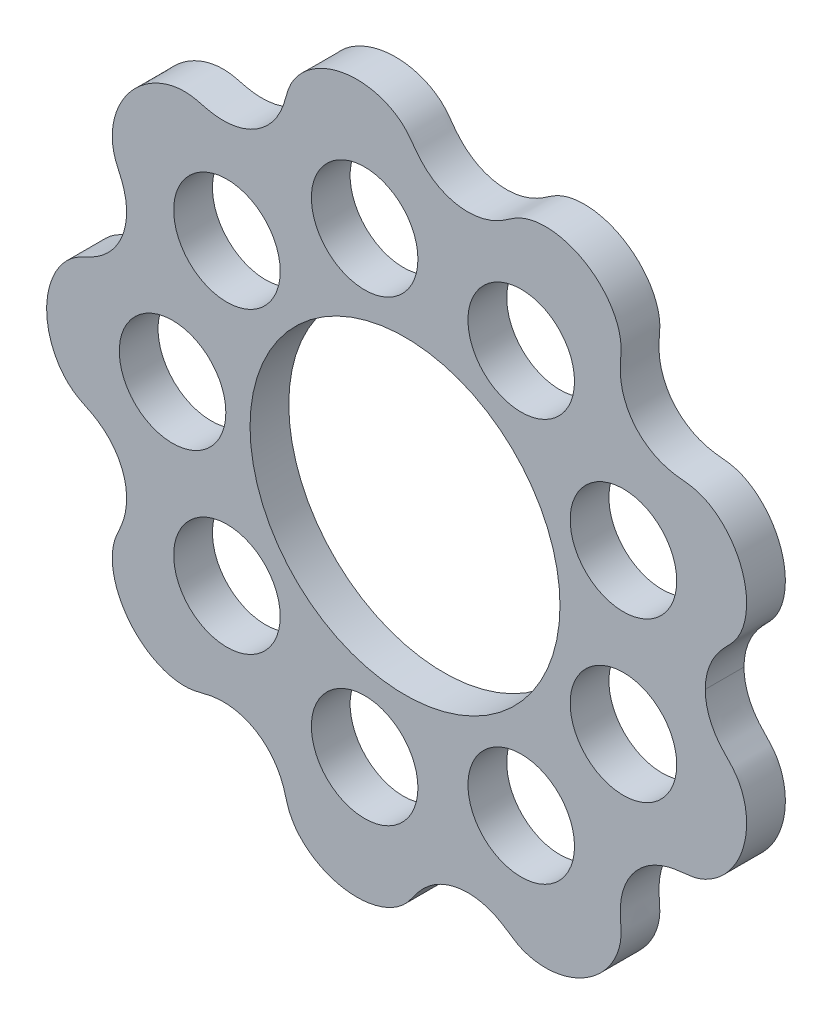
ISO-10303-21;
HEADER;
FILE_DESCRIPTION(('STEP AP214'),'2;1');
FILE_NAME('part.step','',(''),(''),'','','');
FILE_SCHEMA(('AUTOMOTIVE_DESIGN { 1 0 10303 214 1 1 1 1 }'));
ENDSEC;
DATA;
#1=APPLICATION_CONTEXT('core data for automotive mechanical design processes');
#2=APPLICATION_PROTOCOL_DEFINITION('international standard','automotive_design',2000,#1);
#3=PRODUCT_CONTEXT('',#1,'mechanical');
#4=PRODUCT('Part','Part','',(#3));
#5=PRODUCT_RELATED_PRODUCT_CATEGORY('part','',(#4));
#6=PRODUCT_DEFINITION_FORMATION('','',#4);
#7=PRODUCT_DEFINITION_CONTEXT('part definition',#1,'design');
#8=PRODUCT_DEFINITION('design','',#6,#7);
#9=PRODUCT_DEFINITION_SHAPE('','',#8);
#10=(LENGTH_UNIT() NAMED_UNIT(*) SI_UNIT(.MILLI.,.METRE.));
#11=(NAMED_UNIT(*) PLANE_ANGLE_UNIT() SI_UNIT($,.RADIAN.));
#12=(NAMED_UNIT(*) SI_UNIT($,.STERADIAN.) SOLID_ANGLE_UNIT());
#13=UNCERTAINTY_MEASURE_WITH_UNIT(LENGTH_MEASURE(1.E-05),#10,'distance_accuracy_value','');
#14=(GEOMETRIC_REPRESENTATION_CONTEXT(3) GLOBAL_UNCERTAINTY_ASSIGNED_CONTEXT((#13)) GLOBAL_UNIT_ASSIGNED_CONTEXT((#10,
#11,#12)) REPRESENTATION_CONTEXT('',''));
#15=CARTESIAN_POINT('',(0.,0.,0.));
#16=DIRECTION('',(0.,0.,1.));
#17=DIRECTION('',(1.,0.,0.));
#18=AXIS2_PLACEMENT_3D('',#15,#16,#17);
#19=CARTESIAN_POINT('',(196.850001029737,0.,12.7));
#20=CARTESIAN_POINT('',(196.850001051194,0.0460391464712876,12.7));
#21=CARTESIAN_POINT('',(196.852222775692,1.51294311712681,12.7));
#22=CARTESIAN_POINT('',(196.995909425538,4.40039622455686,12.7));
#23=CARTESIAN_POINT('',(197.618960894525,8.67559154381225,12.7));
#24=CARTESIAN_POINT('',(199.214953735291,14.1442813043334,12.7));
#25=CARTESIAN_POINT('',(201.436535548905,19.1054331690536,12.7));
#26=CARTESIAN_POINT('',(204.121217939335,23.5254712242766,12.7));
#27=CARTESIAN_POINT('',(206.757870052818,26.9584996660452,12.7));
#28=CARTESIAN_POINT('',(209.077423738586,29.56045967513,12.7));
#29=CARTESIAN_POINT('',(211.092774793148,31.6506170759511,12.7));
#30=CARTESIAN_POINT('',(212.721954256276,33.3060111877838,12.7));
#31=CARTESIAN_POINT('',(214.404150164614,35.0888076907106,12.7));
#32=CARTESIAN_POINT('',(216.060981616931,37.0674921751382,12.7));
#33=CARTESIAN_POINT('',(217.629453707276,39.277126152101,12.7));
#34=CARTESIAN_POINT('',(219.072825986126,41.7198925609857,12.7));
#35=CARTESIAN_POINT('',(220.364838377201,44.361114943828,12.7));
#36=CARTESIAN_POINT('',(221.487205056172,47.1901899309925,12.7));
#37=CARTESIAN_POINT('',(222.664010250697,50.970777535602,12.7));
#38=CARTESIAN_POINT('',(223.602165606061,55.5498754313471,12.7));
#39=CARTESIAN_POINT('',(224.087110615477,60.8118774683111,12.7));
#40=CARTESIAN_POINT('',(223.921999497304,66.6980379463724,12.7));
#41=CARTESIAN_POINT('',(223.139995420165,72.3253111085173,12.7));
#42=CARTESIAN_POINT('',(221.757628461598,77.8432994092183,12.7));
#43=CARTESIAN_POINT('',(219.794894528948,83.1904302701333,12.7));
#44=CARTESIAN_POINT('',(217.271233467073,88.3054619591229,12.7));
#45=CARTESIAN_POINT('',(214.206353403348,93.1251727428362,12.7));
#46=CARTESIAN_POINT('',(210.504320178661,97.7290960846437,12.7));
#47=CARTESIAN_POINT('',(206.714378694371,101.425642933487,12.7));
#48=CARTESIAN_POINT('',(203.027640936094,104.299747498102,12.7));
#49=CARTESIAN_POINT('',(199.680219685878,106.408116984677,12.7));
#50=CARTESIAN_POINT('',(196.985140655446,107.83055306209,12.7));
#51=CARTESIAN_POINT('',(194.277062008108,108.999523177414,12.7));
#52=CARTESIAN_POINT('',(191.576680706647,109.917517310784,12.7));
#53=CARTESIAN_POINT('',(188.918777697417,110.576327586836,12.7));
#54=CARTESIAN_POINT('',(186.330507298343,111.002411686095,12.7));
#55=CARTESIAN_POINT('',(183.243105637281,111.336764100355,12.7));
#56=CARTESIAN_POINT('',(179.669117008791,111.664277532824,12.7));
#57=CARTESIAN_POINT('',(176.111995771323,112.171948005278,12.7));
#58=CARTESIAN_POINT('',(172.60535650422,112.954650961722,12.7));
#59=CARTESIAN_POINT('',(168.942274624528,114.042132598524,12.7));
#60=CARTESIAN_POINT('',(165.157269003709,115.49876001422,12.7));
#61=CARTESIAN_POINT('',(160.806658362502,117.741293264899,12.7));
#62=CARTESIAN_POINT('',(156.126056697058,121.04233921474,12.7));
#63=CARTESIAN_POINT('',(151.966710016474,124.951893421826,12.7));
#64=CARTESIAN_POINT('',(148.407198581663,129.388969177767,12.7));
#65=CARTESIAN_POINT('',(145.511034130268,134.257231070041,12.7));
#66=CARTESIAN_POINT('',(143.319881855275,139.454904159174,12.7));
#67=CARTESIAN_POINT('',(141.915943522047,144.657877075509,12.7));
#68=CARTESIAN_POINT('',(141.197922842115,149.741610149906,12.7));
#69=CARTESIAN_POINT('',(141.055999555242,154.04239146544,12.7));
#70=CARTESIAN_POINT('',(141.187629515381,157.511769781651,12.7));
#71=CARTESIAN_POINT('',(141.398550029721,160.396104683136,12.7));
#72=CARTESIAN_POINT('',(141.578839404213,162.702602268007,12.7));
#73=CARTESIAN_POINT('',(141.699883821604,165.137580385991,12.7));
#74=CARTESIAN_POINT('',(141.66461325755,167.700425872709,12.7));
#75=CARTESIAN_POINT('',(141.41425282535,170.376223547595,12.7));
#76=CARTESIAN_POINT('',(140.923371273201,173.143814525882,12.7));
#77=CARTESIAN_POINT('',(140.191768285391,175.975447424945,12.7));
#78=CARTESIAN_POINT('',(139.209293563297,178.851091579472,12.7));
#79=CARTESIAN_POINT('',(137.646201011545,182.500357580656,12.7));
#80=CARTESIAN_POINT('',(135.38602964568,186.595401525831,12.7));
#81=CARTESIAN_POINT('',(132.350457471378,190.902205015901,12.7));
#82=CARTESIAN_POINT('',(128.432805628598,195.253326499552,12.7));
#83=CARTESIAN_POINT('',(124.237150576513,199.00053777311,12.7));
#84=CARTESIAN_POINT('',(119.625722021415,202.311858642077,12.7));
#85=CARTESIAN_POINT('',(114.643228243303,205.140711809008,12.7));
#86=CARTESIAN_POINT('',(109.33706310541,207.438263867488,12.7));
#87=CARTESIAN_POINT('',(103.759619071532,209.152059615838,12.7));
#88=CARTESIAN_POINT('',(97.9157508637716,210.243192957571,12.7));
#89=CARTESIAN_POINT('',(92.6540411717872,210.576006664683,12.7));
#90=CARTESIAN_POINT('',(88.0652396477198,210.360710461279,12.7));
#91=CARTESIAN_POINT('',(84.2449365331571,209.806000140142,12.7));
#92=CARTESIAN_POINT('',(81.2950933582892,209.147047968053,12.7));
#93=CARTESIAN_POINT('',(78.4582810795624,208.274419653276,12.7));
#94=CARTESIAN_POINT('',(75.7533290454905,207.192052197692,12.7));
#95=CARTESIAN_POINT('',(73.2740223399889,205.940361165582,12.7));
#96=CARTESIAN_POINT('',(71.0202994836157,204.567040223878,12.7));
#97=CARTESIAN_POINT('',(68.9496098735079,203.164574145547,12.7));
#98=CARTESIAN_POINT('',(67.0004087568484,201.826373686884,12.7));
#99=CARTESIAN_POINT('',(65.0244746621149,200.527294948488,12.7));
#100=CARTESIAN_POINT('',(63.0038698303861,199.298259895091,12.7));
#101=CARTESIAN_POINT('',(60.4137745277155,197.872498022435,12.7));
#102=CARTESIAN_POINT('',(56.9509698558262,196.247537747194,12.7));
#103=CARTESIAN_POINT('',(52.5249855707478,194.669432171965,12.7));
#104=CARTESIAN_POINT('',(47.0782296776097,193.488964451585,12.7));
#105=CARTESIAN_POINT('',(41.241957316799,193.068438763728,12.7));
#106=CARTESIAN_POINT('',(35.4728457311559,193.481033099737,12.7));
#107=CARTESIAN_POINT('',(29.8871835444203,194.689911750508,12.7));
#108=CARTESIAN_POINT('',(24.5921011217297,196.636786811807,12.7));
#109=CARTESIAN_POINT('',(19.6736586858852,199.248451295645,12.7));
#110=CARTESIAN_POINT('',(15.3449762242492,202.348523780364,12.7));
#111=CARTESIAN_POINT('',(11.6055098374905,205.781955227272,12.7));
#112=CARTESIAN_POINT('',(8.78851314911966,208.975293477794,12.7));
#113=CARTESIAN_POINT('',(6.69499512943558,211.704553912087,12.7));
#114=CARTESIAN_POINT('',(5.0236062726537,214.031937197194,12.7));
#115=CARTESIAN_POINT('',(3.68807976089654,215.89500056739,12.7));
#116=CARTESIAN_POINT('',(2.2182487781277,217.808677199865,12.7));
#117=CARTESIAN_POINT('',(0.547121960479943,219.713724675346,12.7));
#118=CARTESIAN_POINT('',(-1.35478829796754,221.565646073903,12.7));
#119=CARTESIAN_POINT('',(-3.49207152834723,223.334116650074,12.7));
#120=CARTESIAN_POINT('',(-6.46569258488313,225.436027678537,12.7));
#121=CARTESIAN_POINT('',(-10.3966100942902,227.657291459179,12.7));
#122=CARTESIAN_POINT('',(-15.2097271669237,229.664746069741,12.7));
#123=CARTESIAN_POINT('',(-20.907566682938,231.21996318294,12.7));
#124=CARTESIAN_POINT('',(-26.5728372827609,232.075047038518,12.7));
#125=CARTESIAN_POINT('',(-32.122703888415,232.308629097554,12.7));
#126=CARTESIAN_POINT('',(-37.679181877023,231.957730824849,12.7));
#127=CARTESIAN_POINT('',(-43.1819835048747,231.028778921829,12.7));
#128=CARTESIAN_POINT('',(-48.5708506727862,229.527800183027,12.7));
#129=CARTESIAN_POINT('',(-53.7834765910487,227.460747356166,12.7));
#130=CARTESIAN_POINT('',(-58.9444294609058,224.735242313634,12.7));
#131=CARTESIAN_POINT('',(-63.9374836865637,221.286781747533,12.7));
#132=CARTESIAN_POINT('',(-67.9165569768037,217.678658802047,12.7));
#133=CARTESIAN_POINT('',(-70.960921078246,214.144706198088,12.7));
#134=CARTESIAN_POINT('',(-73.0898092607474,211.082457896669,12.7));
#135=CARTESIAN_POINT('',(-74.5081876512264,208.666399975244,12.7));
#136=CARTESIAN_POINT('',(-75.6715063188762,206.253324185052,12.7));
#137=CARTESIAN_POINT('',(-76.5951201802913,203.87107437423,12.7));
#138=CARTESIAN_POINT('',(-77.3240468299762,201.552464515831,12.7));
#139=CARTESIAN_POINT('',(-77.9445048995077,199.331017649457,12.7));
#140=CARTESIAN_POINT('',(-78.7252846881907,196.555650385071,12.7));
#141=CARTESIAN_POINT('',(-79.7707118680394,193.256248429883,12.7));
#142=CARTESIAN_POINT('',(-81.3471634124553,189.267084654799,12.7));
#143=CARTESIAN_POINT('',(-83.722345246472,184.734207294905,12.7));
#144=CARTESIAN_POINT('',(-86.7781831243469,180.316669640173,12.7));
#145=CARTESIAN_POINT('',(-90.5689617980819,176.164576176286,12.7));
#146=CARTESIAN_POINT('',(-94.925849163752,172.541671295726,12.7));
#147=CARTESIAN_POINT('',(-99.7820951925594,169.536998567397,12.7));
#148=CARTESIAN_POINT('',(-105.049141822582,167.229418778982,12.7));
#149=CARTESIAN_POINT('',(-110.626794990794,165.678711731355,12.7));
#150=CARTESIAN_POINT('',(-116.096779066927,164.956543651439,12.7));
#151=CARTESIAN_POINT('',(-120.751060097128,164.939869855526,12.7));
#152=CARTESIAN_POINT('',(-124.52670468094,165.286867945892,12.7));
#153=CARTESIAN_POINT('',(-127.425240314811,165.741049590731,12.7));
#154=CARTESIAN_POINT('',(-129.726184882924,166.203169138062,12.7));
#155=CARTESIAN_POINT('',(-132.009439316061,166.744685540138,12.7));
#156=CARTESIAN_POINT('',(-134.28124435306,167.330960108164,12.7));
#157=CARTESIAN_POINT('',(-136.686197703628,167.935329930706,12.7));
#158=CARTESIAN_POINT('',(-139.249508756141,168.45187658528,12.7));
#159=CARTESIAN_POINT('',(-141.979574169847,168.781348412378,12.7));
#160=CARTESIAN_POINT('',(-144.860848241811,168.879485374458,12.7));
#161=CARTESIAN_POINT('',(-147.832687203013,168.738265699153,12.7));
#162=CARTESIAN_POINT('',(-150.875659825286,168.350058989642,12.7));
#163=CARTESIAN_POINT('',(-154.766432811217,167.543813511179,12.7));
#164=CARTESIAN_POINT('',(-159.248821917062,166.131164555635,12.7));
#165=CARTESIAN_POINT('',(-164.123762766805,163.970580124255,12.7));
#166=CARTESIAN_POINT('',(-169.237432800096,160.911658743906,12.7));
#167=CARTESIAN_POINT('',(-173.828925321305,157.41204927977,12.7));
#168=CARTESIAN_POINT('',(-177.995538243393,153.447575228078,12.7));
#169=CARTESIAN_POINT('',(-181.699351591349,149.076023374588,12.7));
#170=CARTESIAN_POINT('',(-184.904191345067,144.352373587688,12.7));
#171=CARTESIAN_POINT('',(-187.574018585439,139.33075547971,12.7));
#172=CARTESIAN_POINT('',(-189.732868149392,133.902900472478,12.7));
#173=CARTESIAN_POINT('',(-191.072024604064,128.868430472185,12.7));
#174=CARTESIAN_POINT('',(-191.765013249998,124.349174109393,12.7));
#175=CARTESIAN_POINT('',(-191.98132112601,120.497913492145,12.7));
#176=CARTESIAN_POINT('',(-191.928744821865,117.504503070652,12.7));
#177=CARTESIAN_POINT('',(-191.657191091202,114.599860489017,12.7));
#178=CARTESIAN_POINT('',(-191.173278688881,111.800386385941,12.7));
#179=CARTESIAN_POINT('',(-190.490617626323,109.172847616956,12.7));
#180=CARTESIAN_POINT('',(-189.640990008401,106.728902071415,12.7));
#181=CARTESIAN_POINT('',(-188.686125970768,104.462523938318,12.7));
#182=CARTESIAN_POINT('',(-187.719898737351,102.340207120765,12.7));
#183=CARTESIAN_POINT('',(-186.52631364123,99.6807541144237,12.7));
#184=CARTESIAN_POINT('',(-185.208429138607,96.4388814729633,12.7));
#185=CARTESIAN_POINT('',(-183.86631469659,92.3103376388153,12.7));
#186=CARTESIAN_POINT('',(-182.807385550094,87.236912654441,12.7));
#187=CARTESIAN_POINT('',(-182.366190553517,81.8107216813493,12.7));
#188=CARTESIAN_POINT('',(-182.684461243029,76.1175646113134,12.7));
#189=CARTESIAN_POINT('',(-183.794267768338,70.502413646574,12.7));
#190=CARTESIAN_POINT('',(-185.688687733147,65.078420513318,12.7));
#191=CARTESIAN_POINT('',(-188.337081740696,59.9614447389,12.7));
#192=CARTESIAN_POINT('',(-191.688985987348,55.2556569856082,12.7));
#193=CARTESIAN_POINT('',(-195.477371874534,51.2555915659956,12.7));
#194=CARTESIAN_POINT('',(-199.075858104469,48.3116283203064,12.7));
#195=CARTESIAN_POINT('',(-202.221888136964,46.1979599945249,12.7));
#196=CARTESIAN_POINT('',(-204.75600869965,44.7152682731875,12.7));
#197=CARTESIAN_POINT('',(-206.829796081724,43.6129741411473,12.7));
#198=CARTESIAN_POINT('',(-208.936590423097,42.575826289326,12.7));
#199=CARTESIAN_POINT('',(-211.056835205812,41.5672959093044,12.7));
#200=CARTESIAN_POINT('',(-213.277741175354,40.4634664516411,12.7));
#201=CARTESIAN_POINT('',(-215.547636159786,39.1681915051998,12.7));
#202=CARTESIAN_POINT('',(-217.815527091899,37.6193309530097,12.7));
#203=CARTESIAN_POINT('',(-220.045450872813,35.800549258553,12.7));
#204=CARTESIAN_POINT('',(-222.169761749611,33.7641274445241,12.7));
#205=CARTESIAN_POINT('',(-224.174368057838,31.5214422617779,12.7));
#206=CARTESIAN_POINT('',(-226.523998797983,28.4612641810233,12.7));
#207=CARTESIAN_POINT('',(-228.950876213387,24.5745027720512,12.7));
#208=CARTESIAN_POINT('',(-231.22675877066,19.8541614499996,12.7));
#209=CARTESIAN_POINT('',(-233.132309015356,14.2779284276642,12.7));
#210=CARTESIAN_POINT('',(-234.375362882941,8.65249671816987,12.7));
#211=CARTESIAN_POINT('',(-234.844405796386,4.34607732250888,12.7));
#212=CARTESIAN_POINT('',(-234.949590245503,1.46003873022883,12.7));
#213=CARTESIAN_POINT('',(-234.950000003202,0.0113315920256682,12.7));
#214=CARTESIAN_POINT('',(-234.950000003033,0.,12.7));
#215=B_SPLINE_CURVE_WITH_KNOTS('',4,(#19,#20,#21,#22,#23,#24,#25,#26,#27,#28,#29,#30,#31,#32,
#33,#34,#35,#36,#37,#38,#39,#40,#41,#42,#43,#44,#45,#46,#47,#48,#49,#50,#51,#52,#53,#54,#55,#56,
#57,#58,#59,#60,#61,#62,#63,#64,#65,#66,#67,#68,#69,#70,#71,#72,#73,#74,#75,#76,#77,#78,#79,#80,
#81,#82,#83,#84,#85,#86,#87,#88,#89,#90,#91,#92,#93,#94,#95,#96,#97,#98,#99,#100,#101,#102,#103,
#104,#105,#106,#107,#108,#109,#110,#111,#112,#113,#114,#115,#116,#117,#118,#119,#120,#121,#122,
#123,#124,#125,#126,#127,#128,#129,#130,#131,#132,#133,#134,#135,#136,#137,#138,#139,#140,#141,
#142,#143,#144,#145,#146,#147,#148,#149,#150,#151,#152,#153,#154,#155,#156,#157,#158,#159,#160,
#161,#162,#163,#164,#165,#166,#167,#168,#169,#170,#171,#172,#173,#174,#175,#176,#177,#178,#179,
#180,#181,#182,#183,#184,#185,#186,#187,#188,#189,#190,#191,#192,#193,#194,#195,#196,#197,#198,
#199,#200,#201,#202,#203,#204,#205,#206,#207,#208,#209,#210,#211,#212,#213,#214),.UNSPECIFIED.,
.F.,.F.,(5,1,1,1,1,1,1,1,1,1,1,1,1,1,1,1,1,1,1,1,1,1,1,1,1,1,1,1,1,1,1,1,1,1,1,1,1,1,1,1,1,1,1,
1,1,1,1,1,1,1,1,1,1,1,1,1,1,1,1,1,1,1,1,1,1,1,1,1,1,1,1,1,1,1,1,1,1,1,1,1,1,1,1,1,1,1,1,1,1,1,1,
1,1,1,1,1,1,1,1,1,1,1,1,1,1,1,1,1,1,1,1,1,1,1,1,1,1,1,1,1,1,1,1,1,1,1,1,1,1,1,1,1,1,1,1,1,1,1,1,
1,1,1,1,1,1,1,1,1,1,1,1,1,1,1,1,1,1,1,1,1,1,1,1,1,1,1,1,1,1,1,1,1,1,1,1,1,1,1,1,1,1,1,1,1,1,1,1,
1,1,1,1,1,5),(0.12272586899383,0.122903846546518,0.128396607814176,0.133889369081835,
0.139372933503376,0.144856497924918,0.149346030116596,0.153835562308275,0.156080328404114,
0.158325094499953,0.160569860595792,0.162814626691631,0.165553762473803,0.168292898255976,
0.171032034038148,0.17377116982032,0.176909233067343,0.180047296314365,0.186323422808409,
0.191803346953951,0.197283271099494,0.202763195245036,0.208243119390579,0.213752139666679,
0.219261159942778,0.224770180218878,0.230279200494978,0.236541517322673,0.23967267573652,
0.242803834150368,0.245557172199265,0.248310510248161,0.251063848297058,0.253817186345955,
0.25612969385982,0.258442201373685,0.263067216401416,0.267692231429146,0.270004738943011,
0.272317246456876,0.277831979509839,0.283346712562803,0.288866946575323,0.294387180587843,
0.299826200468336,0.305265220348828,0.310695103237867,0.316124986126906,0.320596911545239,
0.325068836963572,0.327304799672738,0.329540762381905,0.331776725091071,0.334012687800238,
0.336726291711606,0.339439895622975,0.342153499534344,0.344867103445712,0.348021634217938,
0.351176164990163,0.357485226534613,0.362911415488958,0.368337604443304,0.37376379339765,
0.379189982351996,0.384817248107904,0.390444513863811,0.396071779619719,0.401699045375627,
0.40774740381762,0.410771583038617,0.413795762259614,0.416608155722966,0.419420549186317,
0.422232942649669,0.425045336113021,0.427330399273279,0.429615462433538,0.431900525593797,
0.434185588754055,0.436470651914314,0.438755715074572,0.44332584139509,0.44895826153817,
0.454590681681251,0.460230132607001,0.465869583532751,0.471240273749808,0.476610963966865,
0.481971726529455,0.487332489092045,0.491763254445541,0.496194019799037,0.498409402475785,
0.500624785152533,0.502840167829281,0.505055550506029,0.507733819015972,0.510412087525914,
0.513090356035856,0.515768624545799,0.521798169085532,0.527827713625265,0.533185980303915,
0.538544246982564,0.543902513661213,0.549260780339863,0.554669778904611,0.56007877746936,
0.565487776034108,0.570896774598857,0.577186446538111,0.583476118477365,0.586180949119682,
0.588885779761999,0.591590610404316,0.594295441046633,0.596524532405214,0.598753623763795,
0.600982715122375,0.603211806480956,0.607669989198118,0.612128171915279,0.617539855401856,
0.622951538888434,0.628373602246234,0.633795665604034,0.639375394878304,0.644955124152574,
0.65052828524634,0.656101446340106,0.66063654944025,0.662904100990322,0.665171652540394,
0.667439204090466,0.669706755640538,0.671974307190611,0.674241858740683,0.677024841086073,
0.679807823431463,0.682590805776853,0.685373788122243,0.688514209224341,0.691654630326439,
0.697935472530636,0.703503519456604,0.709071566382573,0.714639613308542,0.720207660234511,
0.725693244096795,0.73117882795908,0.736664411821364,0.742149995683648,0.748227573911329,
0.751266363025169,0.75430515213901,0.757047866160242,0.759790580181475,0.762533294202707,
0.76527600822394,0.767529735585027,0.769783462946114,0.772037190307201,0.774290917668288,
0.778798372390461,0.783305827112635,0.788793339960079,0.794280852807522,0.799779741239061,
0.805278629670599,0.810847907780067,0.816417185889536,0.821978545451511,0.827539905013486,
0.832078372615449,0.834347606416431,0.836616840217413,0.838886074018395,0.841155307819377,
0.843424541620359,0.845693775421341,0.848471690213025,0.851249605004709,0.854027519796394,
0.856805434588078,0.859836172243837,0.862866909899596,0.868928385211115,0.874484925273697,
0.880041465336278,0.88559800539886,0.891154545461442,0.891198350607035),.UNSPECIFIED.);
#216=DIRECTION('',(0.,0.,-1.));
#217=VECTOR('',#216,1.);
#218=SURFACE_OF_LINEAR_EXTRUSION('',#215,#217);
#219=CARTESIAN_POINT('',(196.850001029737,0.,-12.7));
#220=CARTESIAN_POINT('',(196.850001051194,0.0460391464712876,-12.7));
#221=CARTESIAN_POINT('',(196.852222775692,1.51294311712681,-12.7));
#222=CARTESIAN_POINT('',(196.995909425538,4.40039622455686,-12.7));
#223=CARTESIAN_POINT('',(197.618960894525,8.67559154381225,-12.7));
#224=CARTESIAN_POINT('',(199.214953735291,14.1442813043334,-12.7));
#225=CARTESIAN_POINT('',(201.436535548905,19.1054331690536,-12.7));
#226=CARTESIAN_POINT('',(204.121217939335,23.5254712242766,-12.7));
#227=CARTESIAN_POINT('',(206.757870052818,26.9584996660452,-12.7));
#228=CARTESIAN_POINT('',(209.077423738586,29.56045967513,-12.7));
#229=CARTESIAN_POINT('',(211.092774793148,31.6506170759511,-12.7));
#230=CARTESIAN_POINT('',(212.721954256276,33.3060111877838,-12.7));
#231=CARTESIAN_POINT('',(214.404150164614,35.0888076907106,-12.7));
#232=CARTESIAN_POINT('',(216.060981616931,37.0674921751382,-12.7));
#233=CARTESIAN_POINT('',(217.629453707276,39.277126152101,-12.7));
#234=CARTESIAN_POINT('',(219.072825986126,41.7198925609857,-12.7));
#235=CARTESIAN_POINT('',(220.364838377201,44.361114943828,-12.7));
#236=CARTESIAN_POINT('',(221.487205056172,47.1901899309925,-12.7));
#237=CARTESIAN_POINT('',(222.664010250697,50.970777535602,-12.7));
#238=CARTESIAN_POINT('',(223.602165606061,55.5498754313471,-12.7));
#239=CARTESIAN_POINT('',(224.087110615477,60.8118774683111,-12.7));
#240=CARTESIAN_POINT('',(223.921999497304,66.6980379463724,-12.7));
#241=CARTESIAN_POINT('',(223.139995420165,72.3253111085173,-12.7));
#242=CARTESIAN_POINT('',(221.757628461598,77.8432994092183,-12.7));
#243=CARTESIAN_POINT('',(219.794894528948,83.1904302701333,-12.7));
#244=CARTESIAN_POINT('',(217.271233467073,88.3054619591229,-12.7));
#245=CARTESIAN_POINT('',(214.206353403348,93.1251727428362,-12.7));
#246=CARTESIAN_POINT('',(210.504320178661,97.7290960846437,-12.7));
#247=CARTESIAN_POINT('',(206.714378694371,101.425642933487,-12.7));
#248=CARTESIAN_POINT('',(203.027640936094,104.299747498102,-12.7));
#249=CARTESIAN_POINT('',(199.680219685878,106.408116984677,-12.7));
#250=CARTESIAN_POINT('',(196.985140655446,107.83055306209,-12.7));
#251=CARTESIAN_POINT('',(194.277062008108,108.999523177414,-12.7));
#252=CARTESIAN_POINT('',(191.576680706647,109.917517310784,-12.7));
#253=CARTESIAN_POINT('',(188.918777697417,110.576327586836,-12.7));
#254=CARTESIAN_POINT('',(186.330507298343,111.002411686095,-12.7));
#255=CARTESIAN_POINT('',(183.243105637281,111.336764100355,-12.7));
#256=CARTESIAN_POINT('',(179.669117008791,111.664277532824,-12.7));
#257=CARTESIAN_POINT('',(176.111995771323,112.171948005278,-12.7));
#258=CARTESIAN_POINT('',(172.60535650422,112.954650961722,-12.7));
#259=CARTESIAN_POINT('',(168.942274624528,114.042132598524,-12.7));
#260=CARTESIAN_POINT('',(165.157269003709,115.49876001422,-12.7));
#261=CARTESIAN_POINT('',(160.806658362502,117.741293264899,-12.7));
#262=CARTESIAN_POINT('',(156.126056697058,121.04233921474,-12.7));
#263=CARTESIAN_POINT('',(151.966710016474,124.951893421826,-12.7));
#264=CARTESIAN_POINT('',(148.407198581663,129.388969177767,-12.7));
#265=CARTESIAN_POINT('',(145.511034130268,134.257231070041,-12.7));
#266=CARTESIAN_POINT('',(143.319881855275,139.454904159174,-12.7));
#267=CARTESIAN_POINT('',(141.915943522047,144.657877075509,-12.7));
#268=CARTESIAN_POINT('',(141.197922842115,149.741610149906,-12.7));
#269=CARTESIAN_POINT('',(141.055999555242,154.04239146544,-12.7));
#270=CARTESIAN_POINT('',(141.187629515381,157.511769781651,-12.7));
#271=CARTESIAN_POINT('',(141.398550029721,160.396104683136,-12.7));
#272=CARTESIAN_POINT('',(141.578839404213,162.702602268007,-12.7));
#273=CARTESIAN_POINT('',(141.699883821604,165.137580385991,-12.7));
#274=CARTESIAN_POINT('',(141.66461325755,167.700425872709,-12.7));
#275=CARTESIAN_POINT('',(141.41425282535,170.376223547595,-12.7));
#276=CARTESIAN_POINT('',(140.923371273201,173.143814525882,-12.7));
#277=CARTESIAN_POINT('',(140.191768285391,175.975447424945,-12.7));
#278=CARTESIAN_POINT('',(139.209293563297,178.851091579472,-12.7));
#279=CARTESIAN_POINT('',(137.646201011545,182.500357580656,-12.7));
#280=CARTESIAN_POINT('',(135.38602964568,186.595401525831,-12.7));
#281=CARTESIAN_POINT('',(132.350457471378,190.902205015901,-12.7));
#282=CARTESIAN_POINT('',(128.432805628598,195.253326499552,-12.7));
#283=CARTESIAN_POINT('',(124.237150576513,199.00053777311,-12.7));
#284=CARTESIAN_POINT('',(119.625722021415,202.311858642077,-12.7));
#285=CARTESIAN_POINT('',(114.643228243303,205.140711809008,-12.7));
#286=CARTESIAN_POINT('',(109.33706310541,207.438263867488,-12.7));
#287=CARTESIAN_POINT('',(103.759619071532,209.152059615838,-12.7));
#288=CARTESIAN_POINT('',(97.9157508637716,210.243192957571,-12.7));
#289=CARTESIAN_POINT('',(92.6540411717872,210.576006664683,-12.7));
#290=CARTESIAN_POINT('',(88.0652396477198,210.360710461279,-12.7));
#291=CARTESIAN_POINT('',(84.2449365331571,209.806000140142,-12.7));
#292=CARTESIAN_POINT('',(81.2950933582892,209.147047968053,-12.7));
#293=CARTESIAN_POINT('',(78.4582810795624,208.274419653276,-12.7));
#294=CARTESIAN_POINT('',(75.7533290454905,207.192052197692,-12.7));
#295=CARTESIAN_POINT('',(73.2740223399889,205.940361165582,-12.7));
#296=CARTESIAN_POINT('',(71.0202994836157,204.567040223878,-12.7));
#297=CARTESIAN_POINT('',(68.9496098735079,203.164574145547,-12.7));
#298=CARTESIAN_POINT('',(67.0004087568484,201.826373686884,-12.7));
#299=CARTESIAN_POINT('',(65.0244746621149,200.527294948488,-12.7));
#300=CARTESIAN_POINT('',(63.0038698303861,199.298259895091,-12.7));
#301=CARTESIAN_POINT('',(60.4137745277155,197.872498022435,-12.7));
#302=CARTESIAN_POINT('',(56.9509698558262,196.247537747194,-12.7));
#303=CARTESIAN_POINT('',(52.5249855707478,194.669432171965,-12.7));
#304=CARTESIAN_POINT('',(47.0782296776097,193.488964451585,-12.7));
#305=CARTESIAN_POINT('',(41.241957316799,193.068438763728,-12.7));
#306=CARTESIAN_POINT('',(35.4728457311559,193.481033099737,-12.7));
#307=CARTESIAN_POINT('',(29.8871835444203,194.689911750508,-12.7));
#308=CARTESIAN_POINT('',(24.5921011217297,196.636786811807,-12.7));
#309=CARTESIAN_POINT('',(19.6736586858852,199.248451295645,-12.7));
#310=CARTESIAN_POINT('',(15.3449762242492,202.348523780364,-12.7));
#311=CARTESIAN_POINT('',(11.6055098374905,205.781955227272,-12.7));
#312=CARTESIAN_POINT('',(8.78851314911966,208.975293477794,-12.7));
#313=CARTESIAN_POINT('',(6.69499512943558,211.704553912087,-12.7));
#314=CARTESIAN_POINT('',(5.0236062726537,214.031937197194,-12.7));
#315=CARTESIAN_POINT('',(3.68807976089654,215.89500056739,-12.7));
#316=CARTESIAN_POINT('',(2.2182487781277,217.808677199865,-12.7));
#317=CARTESIAN_POINT('',(0.547121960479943,219.713724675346,-12.7));
#318=CARTESIAN_POINT('',(-1.35478829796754,221.565646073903,-12.7));
#319=CARTESIAN_POINT('',(-3.49207152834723,223.334116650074,-12.7));
#320=CARTESIAN_POINT('',(-6.46569258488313,225.436027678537,-12.7));
#321=CARTESIAN_POINT('',(-10.3966100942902,227.657291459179,-12.7));
#322=CARTESIAN_POINT('',(-15.2097271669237,229.664746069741,-12.7));
#323=CARTESIAN_POINT('',(-20.907566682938,231.21996318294,-12.7));
#324=CARTESIAN_POINT('',(-26.5728372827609,232.075047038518,-12.7));
#325=CARTESIAN_POINT('',(-32.122703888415,232.308629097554,-12.7));
#326=CARTESIAN_POINT('',(-37.679181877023,231.957730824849,-12.7));
#327=CARTESIAN_POINT('',(-43.1819835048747,231.028778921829,-12.7));
#328=CARTESIAN_POINT('',(-48.5708506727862,229.527800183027,-12.7));
#329=CARTESIAN_POINT('',(-53.7834765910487,227.460747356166,-12.7));
#330=CARTESIAN_POINT('',(-58.9444294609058,224.735242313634,-12.7));
#331=CARTESIAN_POINT('',(-63.9374836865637,221.286781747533,-12.7));
#332=CARTESIAN_POINT('',(-67.9165569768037,217.678658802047,-12.7));
#333=CARTESIAN_POINT('',(-70.960921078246,214.144706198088,-12.7));
#334=CARTESIAN_POINT('',(-73.0898092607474,211.082457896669,-12.7));
#335=CARTESIAN_POINT('',(-74.5081876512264,208.666399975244,-12.7));
#336=CARTESIAN_POINT('',(-75.6715063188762,206.253324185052,-12.7));
#337=CARTESIAN_POINT('',(-76.5951201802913,203.87107437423,-12.7));
#338=CARTESIAN_POINT('',(-77.3240468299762,201.552464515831,-12.7));
#339=CARTESIAN_POINT('',(-77.9445048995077,199.331017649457,-12.7));
#340=CARTESIAN_POINT('',(-78.7252846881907,196.555650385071,-12.7));
#341=CARTESIAN_POINT('',(-79.7707118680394,193.256248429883,-12.7));
#342=CARTESIAN_POINT('',(-81.3471634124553,189.267084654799,-12.7));
#343=CARTESIAN_POINT('',(-83.722345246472,184.734207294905,-12.7));
#344=CARTESIAN_POINT('',(-86.7781831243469,180.316669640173,-12.7));
#345=CARTESIAN_POINT('',(-90.5689617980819,176.164576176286,-12.7));
#346=CARTESIAN_POINT('',(-94.925849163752,172.541671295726,-12.7));
#347=CARTESIAN_POINT('',(-99.7820951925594,169.536998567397,-12.7));
#348=CARTESIAN_POINT('',(-105.049141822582,167.229418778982,-12.7));
#349=CARTESIAN_POINT('',(-110.626794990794,165.678711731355,-12.7));
#350=CARTESIAN_POINT('',(-116.096779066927,164.956543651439,-12.7));
#351=CARTESIAN_POINT('',(-120.751060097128,164.939869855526,-12.7));
#352=CARTESIAN_POINT('',(-124.52670468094,165.286867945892,-12.7));
#353=CARTESIAN_POINT('',(-127.425240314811,165.741049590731,-12.7));
#354=CARTESIAN_POINT('',(-129.726184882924,166.203169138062,-12.7));
#355=CARTESIAN_POINT('',(-132.009439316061,166.744685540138,-12.7));
#356=CARTESIAN_POINT('',(-134.28124435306,167.330960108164,-12.7));
#357=CARTESIAN_POINT('',(-136.686197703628,167.935329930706,-12.7));
#358=CARTESIAN_POINT('',(-139.249508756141,168.45187658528,-12.7));
#359=CARTESIAN_POINT('',(-141.979574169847,168.781348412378,-12.7));
#360=CARTESIAN_POINT('',(-144.860848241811,168.879485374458,-12.7));
#361=CARTESIAN_POINT('',(-147.832687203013,168.738265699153,-12.7));
#362=CARTESIAN_POINT('',(-150.875659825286,168.350058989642,-12.7));
#363=CARTESIAN_POINT('',(-154.766432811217,167.543813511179,-12.7));
#364=CARTESIAN_POINT('',(-159.248821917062,166.131164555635,-12.7));
#365=CARTESIAN_POINT('',(-164.123762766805,163.970580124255,-12.7));
#366=CARTESIAN_POINT('',(-169.237432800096,160.911658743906,-12.7));
#367=CARTESIAN_POINT('',(-173.828925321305,157.41204927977,-12.7));
#368=CARTESIAN_POINT('',(-177.995538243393,153.447575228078,-12.7));
#369=CARTESIAN_POINT('',(-181.699351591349,149.076023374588,-12.7));
#370=CARTESIAN_POINT('',(-184.904191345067,144.352373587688,-12.7));
#371=CARTESIAN_POINT('',(-187.574018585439,139.33075547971,-12.7));
#372=CARTESIAN_POINT('',(-189.732868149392,133.902900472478,-12.7));
#373=CARTESIAN_POINT('',(-191.072024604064,128.868430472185,-12.7));
#374=CARTESIAN_POINT('',(-191.765013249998,124.349174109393,-12.7));
#375=CARTESIAN_POINT('',(-191.98132112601,120.497913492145,-12.7));
#376=CARTESIAN_POINT('',(-191.928744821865,117.504503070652,-12.7));
#377=CARTESIAN_POINT('',(-191.657191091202,114.599860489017,-12.7));
#378=CARTESIAN_POINT('',(-191.173278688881,111.800386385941,-12.7));
#379=CARTESIAN_POINT('',(-190.490617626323,109.172847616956,-12.7));
#380=CARTESIAN_POINT('',(-189.640990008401,106.728902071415,-12.7));
#381=CARTESIAN_POINT('',(-188.686125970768,104.462523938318,-12.7));
#382=CARTESIAN_POINT('',(-187.719898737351,102.340207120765,-12.7));
#383=CARTESIAN_POINT('',(-186.52631364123,99.6807541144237,-12.7));
#384=CARTESIAN_POINT('',(-185.208429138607,96.4388814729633,-12.7));
#385=CARTESIAN_POINT('',(-183.86631469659,92.3103376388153,-12.7));
#386=CARTESIAN_POINT('',(-182.807385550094,87.236912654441,-12.7));
#387=CARTESIAN_POINT('',(-182.366190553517,81.8107216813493,-12.7));
#388=CARTESIAN_POINT('',(-182.684461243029,76.1175646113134,-12.7));
#389=CARTESIAN_POINT('',(-183.794267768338,70.502413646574,-12.7));
#390=CARTESIAN_POINT('',(-185.688687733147,65.078420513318,-12.7));
#391=CARTESIAN_POINT('',(-188.337081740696,59.9614447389,-12.7));
#392=CARTESIAN_POINT('',(-191.688985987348,55.2556569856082,-12.7));
#393=CARTESIAN_POINT('',(-195.477371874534,51.2555915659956,-12.7));
#394=CARTESIAN_POINT('',(-199.075858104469,48.3116283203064,-12.7));
#395=CARTESIAN_POINT('',(-202.221888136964,46.1979599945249,-12.7));
#396=CARTESIAN_POINT('',(-204.75600869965,44.7152682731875,-12.7));
#397=CARTESIAN_POINT('',(-206.829796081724,43.6129741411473,-12.7));
#398=CARTESIAN_POINT('',(-208.936590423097,42.575826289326,-12.7));
#399=CARTESIAN_POINT('',(-211.056835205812,41.5672959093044,-12.7));
#400=CARTESIAN_POINT('',(-213.277741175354,40.4634664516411,-12.7));
#401=CARTESIAN_POINT('',(-215.547636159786,39.1681915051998,-12.7));
#402=CARTESIAN_POINT('',(-217.815527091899,37.6193309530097,-12.7));
#403=CARTESIAN_POINT('',(-220.045450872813,35.800549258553,-12.7));
#404=CARTESIAN_POINT('',(-222.169761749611,33.7641274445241,-12.7));
#405=CARTESIAN_POINT('',(-224.174368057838,31.5214422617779,-12.7));
#406=CARTESIAN_POINT('',(-226.523998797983,28.4612641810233,-12.7));
#407=CARTESIAN_POINT('',(-228.950876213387,24.5745027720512,-12.7));
#408=CARTESIAN_POINT('',(-231.22675877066,19.8541614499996,-12.7));
#409=CARTESIAN_POINT('',(-233.132309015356,14.2779284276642,-12.7));
#410=CARTESIAN_POINT('',(-234.375362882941,8.65249671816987,-12.7));
#411=CARTESIAN_POINT('',(-234.844405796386,4.34607732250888,-12.7));
#412=CARTESIAN_POINT('',(-234.949590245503,1.46003873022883,-12.7));
#413=CARTESIAN_POINT('',(-234.950000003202,0.0113315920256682,-12.7));
#414=CARTESIAN_POINT('',(-234.950000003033,0.,-12.7));
#415=B_SPLINE_CURVE_WITH_KNOTS('',4,(#219,#220,#221,#222,#223,#224,#225,#226,#227,#228,#229,
#230,#231,#232,#233,#234,#235,#236,#237,#238,#239,#240,#241,#242,#243,#244,#245,#246,#247,#248,
#249,#250,#251,#252,#253,#254,#255,#256,#257,#258,#259,#260,#261,#262,#263,#264,#265,#266,#267,
#268,#269,#270,#271,#272,#273,#274,#275,#276,#277,#278,#279,#280,#281,#282,#283,#284,#285,#286,
#287,#288,#289,#290,#291,#292,#293,#294,#295,#296,#297,#298,#299,#300,#301,#302,#303,#304,#305,
#306,#307,#308,#309,#310,#311,#312,#313,#314,#315,#316,#317,#318,#319,#320,#321,#322,#323,#324,
#325,#326,#327,#328,#329,#330,#331,#332,#333,#334,#335,#336,#337,#338,#339,#340,#341,#342,#343,
#344,#345,#346,#347,#348,#349,#350,#351,#352,#353,#354,#355,#356,#357,#358,#359,#360,#361,#362,
#363,#364,#365,#366,#367,#368,#369,#370,#371,#372,#373,#374,#375,#376,#377,#378,#379,#380,#381,
#382,#383,#384,#385,#386,#387,#388,#389,#390,#391,#392,#393,#394,#395,#396,#397,#398,#399,#400,
#401,#402,#403,#404,#405,#406,#407,#408,#409,#410,#411,#412,#413,#414),.UNSPECIFIED.,.F.,.F.,(5,
1,1,1,1,1,1,1,1,1,1,1,1,1,1,1,1,1,1,1,1,1,1,1,1,1,1,1,1,1,1,1,1,1,1,1,1,1,1,1,1,1,1,1,1,1,1,1,1,
1,1,1,1,1,1,1,1,1,1,1,1,1,1,1,1,1,1,1,1,1,1,1,1,1,1,1,1,1,1,1,1,1,1,1,1,1,1,1,1,1,1,1,1,1,1,1,1,
1,1,1,1,1,1,1,1,1,1,1,1,1,1,1,1,1,1,1,1,1,1,1,1,1,1,1,1,1,1,1,1,1,1,1,1,1,1,1,1,1,1,1,1,1,1,1,1,
1,1,1,1,1,1,1,1,1,1,1,1,1,1,1,1,1,1,1,1,1,1,1,1,1,1,1,1,1,1,1,1,1,1,1,1,1,1,1,1,1,1,1,1,1,1,1,
5),(0.12272586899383,0.122903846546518,0.128396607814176,0.133889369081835,0.139372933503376,
0.144856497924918,0.149346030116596,0.153835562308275,0.156080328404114,0.158325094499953,
0.160569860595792,0.162814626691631,0.165553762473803,0.168292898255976,0.171032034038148,
0.17377116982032,0.176909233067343,0.180047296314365,0.186323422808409,0.191803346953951,
0.197283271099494,0.202763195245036,0.208243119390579,0.213752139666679,0.219261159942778,
0.224770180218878,0.230279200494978,0.236541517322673,0.23967267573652,0.242803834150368,
0.245557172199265,0.248310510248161,0.251063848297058,0.253817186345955,0.25612969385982,
0.258442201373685,0.263067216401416,0.267692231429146,0.270004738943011,0.272317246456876,
0.277831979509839,0.283346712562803,0.288866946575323,0.294387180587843,0.299826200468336,
0.305265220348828,0.310695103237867,0.316124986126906,0.320596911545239,0.325068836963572,
0.327304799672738,0.329540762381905,0.331776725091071,0.334012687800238,0.336726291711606,
0.339439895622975,0.342153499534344,0.344867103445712,0.348021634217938,0.351176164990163,
0.357485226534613,0.362911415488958,0.368337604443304,0.37376379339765,0.379189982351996,
0.384817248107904,0.390444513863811,0.396071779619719,0.401699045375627,0.40774740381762,
0.410771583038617,0.413795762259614,0.416608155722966,0.419420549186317,0.422232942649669,
0.425045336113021,0.427330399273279,0.429615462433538,0.431900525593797,0.434185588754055,
0.436470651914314,0.438755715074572,0.44332584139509,0.44895826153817,0.454590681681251,
0.460230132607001,0.465869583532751,0.471240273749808,0.476610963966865,0.481971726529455,
0.487332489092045,0.491763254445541,0.496194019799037,0.498409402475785,0.500624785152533,
0.502840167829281,0.505055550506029,0.507733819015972,0.510412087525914,0.513090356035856,
0.515768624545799,0.521798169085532,0.527827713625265,0.533185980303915,0.538544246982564,
0.543902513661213,0.549260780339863,0.554669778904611,0.56007877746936,0.565487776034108,
0.570896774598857,0.577186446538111,0.583476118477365,0.586180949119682,0.588885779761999,
0.591590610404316,0.594295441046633,0.596524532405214,0.598753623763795,0.600982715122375,
0.603211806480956,0.607669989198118,0.612128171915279,0.617539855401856,0.622951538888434,
0.628373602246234,0.633795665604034,0.639375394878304,0.644955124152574,0.65052828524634,
0.656101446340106,0.66063654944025,0.662904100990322,0.665171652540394,0.667439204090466,
0.669706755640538,0.671974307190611,0.674241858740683,0.677024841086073,0.679807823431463,
0.682590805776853,0.685373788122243,0.688514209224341,0.691654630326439,0.697935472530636,
0.703503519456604,0.709071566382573,0.714639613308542,0.720207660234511,0.725693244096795,
0.73117882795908,0.736664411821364,0.742149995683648,0.748227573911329,0.751266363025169,
0.75430515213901,0.757047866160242,0.759790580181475,0.762533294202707,0.76527600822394,
0.767529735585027,0.769783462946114,0.772037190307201,0.774290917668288,0.778798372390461,
0.783305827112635,0.788793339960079,0.794280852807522,0.799779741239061,0.805278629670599,
0.810847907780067,0.816417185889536,0.821978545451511,0.827539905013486,0.832078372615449,
0.834347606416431,0.836616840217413,0.838886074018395,0.841155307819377,0.843424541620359,
0.845693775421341,0.848471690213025,0.851249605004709,0.854027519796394,0.856805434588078,
0.859836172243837,0.862866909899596,0.868928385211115,0.874484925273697,0.880041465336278,
0.88559800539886,0.891154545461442,0.891198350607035),.UNSPECIFIED.);
#416=CARTESIAN_POINT('',(196.850001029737,0.,-12.7));
#417=VERTEX_POINT('',#416);
#418=CARTESIAN_POINT('',(-234.950000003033,-4.35705907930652E-10,-12.7));
#419=VERTEX_POINT('',#418);
#420=EDGE_CURVE('E64',#417,#419,#415,.T.);
#421=ORIENTED_EDGE('',*,*,#420,.T.);
#422=DIRECTION('',(0.,0.,-1.));
#423=VECTOR('',#422,1.);
#424=CARTESIAN_POINT('',(-234.950000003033,-4.35705907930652E-10,12.7));
#425=LINE('',#424,#423);
#426=CARTESIAN_POINT('',(-234.950000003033,-4.35705907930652E-10,12.7));
#427=VERTEX_POINT('',#426);
#428=EDGE_CURVE('E11',#427,#419,#425,.T.);
#429=ORIENTED_EDGE('',*,*,#428,.F.);
#430=CARTESIAN_POINT('',(196.850001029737,0.,12.7));
#431=VERTEX_POINT('',#430);
#432=EDGE_CURVE('E63',#431,#427,#215,.T.);
#433=ORIENTED_EDGE('',*,*,#432,.F.);
#434=DIRECTION('',(0.,0.,-1.));
#435=VECTOR('',#434,1.);
#436=CARTESIAN_POINT('',(196.850001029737,0.,12.7));
#437=LINE('',#436,#435);
#438=EDGE_CURVE('E41',#431,#417,#437,.T.);
#439=ORIENTED_EDGE('',*,*,#438,.T.);
#440=EDGE_LOOP('',(#421,#429,#433,#439));
#441=FACE_BOUND('',#440,.T.);
#442=ADVANCED_FACE('F32',(#441),#218,.F.);
#443=CARTESIAN_POINT('',(-234.950000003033,-4.35705907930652E-10,12.7));
#444=CARTESIAN_POINT('',(-234.950000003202,-0.0113315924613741,12.7));
#445=CARTESIAN_POINT('',(-234.949590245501,-1.46003873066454,12.7));
#446=CARTESIAN_POINT('',(-234.844405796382,-4.34607732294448,12.7));
#447=CARTESIAN_POINT('',(-234.375362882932,-8.652496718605,12.7));
#448=CARTESIAN_POINT('',(-233.132309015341,-14.277928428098,12.7));
#449=CARTESIAN_POINT('',(-231.22675877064,-19.8541614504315,12.7));
#450=CARTESIAN_POINT('',(-228.950876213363,-24.5745027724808,12.7));
#451=CARTESIAN_POINT('',(-226.523998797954,-28.4612641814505,12.7));
#452=CARTESIAN_POINT('',(-224.174368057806,-31.5214422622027,12.7));
#453=CARTESIAN_POINT('',(-222.169761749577,-33.764127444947,12.7));
#454=CARTESIAN_POINT('',(-220.045450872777,-35.8005492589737,12.7));
#455=CARTESIAN_POINT('',(-217.815527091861,-37.6193309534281,12.7));
#456=CARTESIAN_POINT('',(-215.547636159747,-39.1681915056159,12.7));
#457=CARTESIAN_POINT('',(-213.277741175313,-40.4634664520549,12.7));
#458=CARTESIAN_POINT('',(-211.05683520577,-41.567295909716,12.7));
#459=CARTESIAN_POINT('',(-208.936590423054,-42.5758262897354,12.7));
#460=CARTESIAN_POINT('',(-206.82979608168,-43.6129741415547,12.7));
#461=CARTESIAN_POINT('',(-204.756008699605,-44.7152682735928,12.7));
#462=CARTESIAN_POINT('',(-202.221888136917,-46.1979599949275,12.7));
#463=CARTESIAN_POINT('',(-199.07585810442,-48.3116283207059,12.7));
#464=CARTESIAN_POINT('',(-195.477371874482,-51.2555915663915,12.7));
#465=CARTESIAN_POINT('',(-191.688985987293,-55.2556569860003,12.7));
#466=CARTESIAN_POINT('',(-188.337081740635,-59.9614447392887,12.7));
#467=CARTESIAN_POINT('',(-185.688687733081,-65.078420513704,12.7));
#468=CARTESIAN_POINT('',(-183.794267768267,-70.5024136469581,12.7));
#469=CARTESIAN_POINT('',(-182.684461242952,-76.1175646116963,12.7));
#470=CARTESIAN_POINT('',(-182.366190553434,-81.8107216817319,12.7));
#471=CARTESIAN_POINT('',(-182.807385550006,-87.236912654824,12.7));
#472=CARTESIAN_POINT('',(-183.866314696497,-92.3103376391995,12.7));
#473=CARTESIAN_POINT('',(-185.20842913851,-96.4388814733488,12.7));
#474=CARTESIAN_POINT('',(-186.526313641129,-99.6807541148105,12.7));
#475=CARTESIAN_POINT('',(-187.719898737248,-102.340207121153,12.7));
#476=CARTESIAN_POINT('',(-188.686125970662,-104.462523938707,12.7));
#477=CARTESIAN_POINT('',(-189.640990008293,-106.728902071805,12.7));
#478=CARTESIAN_POINT('',(-190.490617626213,-109.172847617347,12.7));
#479=CARTESIAN_POINT('',(-191.173278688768,-111.800386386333,12.7));
#480=CARTESIAN_POINT('',(-191.657191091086,-114.599860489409,12.7));
#481=CARTESIAN_POINT('',(-191.928744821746,-117.504503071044,12.7));
#482=CARTESIAN_POINT('',(-191.981321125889,-120.497913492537,12.7));
#483=CARTESIAN_POINT('',(-191.765013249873,-124.349174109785,12.7));
#484=CARTESIAN_POINT('',(-191.072024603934,-128.868430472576,12.7));
#485=CARTESIAN_POINT('',(-189.732868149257,-133.902900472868,12.7));
#486=CARTESIAN_POINT('',(-187.574018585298,-139.330755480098,12.7));
#487=CARTESIAN_POINT('',(-184.904191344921,-144.352373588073,12.7));
#488=CARTESIAN_POINT('',(-181.699351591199,-149.076023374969,12.7));
#489=CARTESIAN_POINT('',(-177.995538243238,-153.447575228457,12.7));
#490=CARTESIAN_POINT('',(-173.828925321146,-157.412049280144,12.7));
#491=CARTESIAN_POINT('',(-169.237432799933,-160.911658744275,12.7));
#492=CARTESIAN_POINT('',(-164.12376276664,-163.97058012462,12.7));
#493=CARTESIAN_POINT('',(-159.248821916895,-166.131164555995,12.7));
#494=CARTESIAN_POINT('',(-154.766432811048,-167.543813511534,12.7));
#495=CARTESIAN_POINT('',(-150.875659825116,-168.350058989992,12.7));
#496=CARTESIAN_POINT('',(-147.832687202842,-168.738265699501,12.7));
#497=CARTESIAN_POINT('',(-144.860848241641,-168.879485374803,12.7));
#498=CARTESIAN_POINT('',(-141.979574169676,-168.78134841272,12.7));
#499=CARTESIAN_POINT('',(-139.249508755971,-168.451876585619,12.7));
#500=CARTESIAN_POINT('',(-136.686197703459,-167.935329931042,12.7));
#501=CARTESIAN_POINT('',(-134.281244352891,-167.330960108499,12.7));
#502=CARTESIAN_POINT('',(-132.009439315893,-166.74468554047,12.7));
#503=CARTESIAN_POINT('',(-129.726184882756,-166.203169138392,12.7));
#504=CARTESIAN_POINT('',(-127.425240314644,-165.741049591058,12.7));
#505=CARTESIAN_POINT('',(-124.526704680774,-165.286867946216,12.7));
#506=CARTESIAN_POINT('',(-120.751060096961,-164.939869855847,12.7));
#507=CARTESIAN_POINT('',(-116.096779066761,-164.956543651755,12.7));
#508=CARTESIAN_POINT('',(-110.626794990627,-165.678711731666,12.7));
#509=CARTESIAN_POINT('',(-105.049141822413,-167.229418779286,12.7));
#510=CARTESIAN_POINT('',(-99.7820951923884,-169.536998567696,12.7));
#511=CARTESIAN_POINT('',(-94.9258491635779,-172.54167129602,12.7));
#512=CARTESIAN_POINT('',(-90.5689617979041,-176.164576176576,12.7));
#513=CARTESIAN_POINT('',(-86.778183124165,-180.316669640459,12.7));
#514=CARTESIAN_POINT('',(-83.7223452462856,-184.734207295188,12.7));
#515=CARTESIAN_POINT('',(-81.3471634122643,-189.26708465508,12.7));
#516=CARTESIAN_POINT('',(-79.7707118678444,-193.256248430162,12.7));
#517=CARTESIAN_POINT('',(-78.7252846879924,-196.555650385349,12.7));
#518=CARTESIAN_POINT('',(-77.9445048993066,-199.331017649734,12.7));
#519=CARTESIAN_POINT('',(-77.3240468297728,-201.552464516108,12.7));
#520=CARTESIAN_POINT('',(-76.5951201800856,-203.871074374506,12.7));
#521=CARTESIAN_POINT('',(-75.6715063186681,-206.253324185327,12.7));
#522=CARTESIAN_POINT('',(-74.5081876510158,-208.666399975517,12.7));
#523=CARTESIAN_POINT('',(-73.0898092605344,-211.082457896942,12.7));
#524=CARTESIAN_POINT('',(-70.96092107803,-214.144706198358,12.7));
#525=CARTESIAN_POINT('',(-67.9165569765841,-217.678658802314,12.7));
#526=CARTESIAN_POINT('',(-63.9374836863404,-221.286781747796,12.7));
#527=CARTESIAN_POINT('',(-58.944429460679,-224.735242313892,12.7));
#528=CARTESIAN_POINT('',(-53.7834765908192,-227.460747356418,12.7));
#529=CARTESIAN_POINT('',(-48.5708506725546,-229.527800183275,12.7));
#530=CARTESIAN_POINT('',(-43.1819835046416,-231.028778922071,12.7));
#531=CARTESIAN_POINT('',(-37.679181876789,-231.957730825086,12.7));
#532=CARTESIAN_POINT('',(-32.1227038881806,-232.308629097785,12.7));
#533=CARTESIAN_POINT('',(-26.5728372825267,-232.075047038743,12.7));
#534=CARTESIAN_POINT('',(-20.9075666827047,-231.21996318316,12.7));
#535=CARTESIAN_POINT('',(-15.209727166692,-229.664746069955,12.7));
#536=CARTESIAN_POINT('',(-10.3966100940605,-227.657291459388,12.7));
#537=CARTESIAN_POINT('',(-6.46569258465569,-225.436027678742,12.7));
#538=CARTESIAN_POINT('',(-3.49207152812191,-223.334116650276,12.7));
#539=CARTESIAN_POINT('',(-1.354788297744,-221.565646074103,12.7));
#540=CARTESIAN_POINT('',(0.547121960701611,-219.713724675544,12.7));
#541=CARTESIAN_POINT('',(2.21824877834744,-217.808677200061,12.7));
#542=CARTESIAN_POINT('',(3.68807976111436,-215.895000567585,12.7));
#543=CARTESIAN_POINT('',(5.02360627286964,-214.031937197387,12.7));
#544=CARTESIAN_POINT('',(6.69499512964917,-211.704553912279,12.7));
#545=CARTESIAN_POINT('',(8.78851314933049,-208.975293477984,12.7));
#546=CARTESIAN_POINT('',(11.6055098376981,-205.781955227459,12.7));
#547=CARTESIAN_POINT('',(15.3449762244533,-202.348523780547,12.7));
#548=CARTESIAN_POINT('',(19.6736586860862,-199.248451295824,12.7));
#549=CARTESIAN_POINT('',(24.5921011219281,-196.636786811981,12.7));
#550=CARTESIAN_POINT('',(29.8871835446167,-194.689911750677,12.7));
#551=CARTESIAN_POINT('',(35.4728457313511,-193.481033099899,12.7));
#552=CARTESIAN_POINT('',(41.2419573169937,-193.068438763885,12.7));
#553=CARTESIAN_POINT('',(47.0782296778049,-193.488964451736,12.7));
#554=CARTESIAN_POINT('',(52.5249855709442,-194.66943217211,12.7));
#555=CARTESIAN_POINT('',(56.9509698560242,-196.247537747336,12.7));
#556=CARTESIAN_POINT('',(60.4137745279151,-197.872498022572,12.7));
#557=CARTESIAN_POINT('',(63.0038698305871,-199.298259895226,12.7));
#558=CARTESIAN_POINT('',(65.0244746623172,-200.527294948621,12.7));
#559=CARTESIAN_POINT('',(67.000408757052,-201.826373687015,12.7));
#560=CARTESIAN_POINT('',(68.9496098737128,-203.164574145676,12.7));
#561=CARTESIAN_POINT('',(71.020299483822,-204.567040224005,12.7));
#562=CARTESIAN_POINT('',(73.2740223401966,-205.940361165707,12.7));
#563=CARTESIAN_POINT('',(75.7533290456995,-207.192052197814,12.7));
#564=CARTESIAN_POINT('',(78.4582810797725,-208.274419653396,12.7));
#565=CARTESIAN_POINT('',(81.2950933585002,-209.14704796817,12.7));
#566=CARTESIAN_POINT('',(84.2449365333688,-209.806000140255,12.7));
#567=CARTESIAN_POINT('',(88.0652396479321,-210.360710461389,12.7));
#568=CARTESIAN_POINT('',(92.6540411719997,-210.576006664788,12.7));
#569=CARTESIAN_POINT('',(97.9157508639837,-210.243192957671,12.7));
#570=CARTESIAN_POINT('',(103.759619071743,-209.152059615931,12.7));
#571=CARTESIAN_POINT('',(109.337063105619,-207.438263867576,12.7));
#572=CARTESIAN_POINT('',(114.64322824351,-205.140711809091,12.7));
#573=CARTESIAN_POINT('',(119.625722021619,-202.311858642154,12.7));
#574=CARTESIAN_POINT('',(124.237150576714,-199.000537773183,12.7));
#575=CARTESIAN_POINT('',(128.432805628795,-195.253326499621,12.7));
#576=CARTESIAN_POINT('',(132.35045747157,-190.902205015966,12.7));
#577=CARTESIAN_POINT('',(135.386029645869,-186.595401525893,12.7));
#578=CARTESIAN_POINT('',(137.646201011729,-182.500357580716,12.7));
#579=CARTESIAN_POINT('',(139.209293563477,-178.85109157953,12.7));
#580=CARTESIAN_POINT('',(140.191768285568,-175.975447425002,12.7));
#581=CARTESIAN_POINT('',(140.923371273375,-173.143814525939,12.7));
#582=CARTESIAN_POINT('',(141.414252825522,-170.376223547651,12.7));
#583=CARTESIAN_POINT('',(141.664613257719,-167.700425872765,12.7));
#584=CARTESIAN_POINT('',(141.69988382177,-165.137580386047,12.7));
#585=CARTESIAN_POINT('',(141.578839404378,-162.702602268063,12.7));
#586=CARTESIAN_POINT('',(141.398550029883,-160.396104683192,12.7));
#587=CARTESIAN_POINT('',(141.18762951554,-157.511769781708,12.7));
#588=CARTESIAN_POINT('',(141.055999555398,-154.042391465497,12.7));
#589=CARTESIAN_POINT('',(141.197922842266,-149.741610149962,12.7));
#590=CARTESIAN_POINT('',(141.915943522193,-144.657877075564,12.7));
#591=CARTESIAN_POINT('',(143.319881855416,-139.454904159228,12.7));
#592=CARTESIAN_POINT('',(145.511034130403,-134.257231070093,12.7));
#593=CARTESIAN_POINT('',(148.407198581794,-129.388969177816,12.7));
#594=CARTESIAN_POINT('',(151.966710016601,-124.951893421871,12.7));
#595=CARTESIAN_POINT('',(156.12605669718,-121.042339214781,12.7));
#596=CARTESIAN_POINT('',(160.806658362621,-117.741293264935,12.7));
#597=CARTESIAN_POINT('',(165.157269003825,-115.498760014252,12.7));
#598=CARTESIAN_POINT('',(168.942274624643,-114.042132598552,12.7));
#599=CARTESIAN_POINT('',(172.605356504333,-112.954650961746,12.7));
#600=CARTESIAN_POINT('',(176.111995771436,-112.171948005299,12.7));
#601=CARTESIAN_POINT('',(179.669117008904,-111.664277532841,12.7));
#602=CARTESIAN_POINT('',(183.243105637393,-111.336764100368,12.7));
#603=CARTESIAN_POINT('',(186.330507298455,-111.002411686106,12.7));
#604=CARTESIAN_POINT('',(188.918777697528,-110.576327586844,12.7));
#605=CARTESIAN_POINT('',(191.576680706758,-109.917517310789,12.7));
#606=CARTESIAN_POINT('',(194.277062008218,-108.999523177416,12.7));
#607=CARTESIAN_POINT('',(196.985140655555,-107.830553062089,12.7));
#608=CARTESIAN_POINT('',(199.680219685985,-106.408116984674,12.7));
#609=CARTESIAN_POINT('',(203.0276409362,-104.299747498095,12.7));
#610=CARTESIAN_POINT('',(206.714378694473,-101.425642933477,12.7));
#611=CARTESIAN_POINT('',(210.504320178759,-97.7290960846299,12.7));
#612=CARTESIAN_POINT('',(214.206353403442,-93.1251727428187,12.7));
#613=CARTESIAN_POINT('',(217.271233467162,-88.3054619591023,12.7));
#614=CARTESIAN_POINT('',(219.794894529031,-83.1904302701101,12.7));
#615=CARTESIAN_POINT('',(221.757628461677,-77.8432994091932,12.7));
#616=CARTESIAN_POINT('',(223.139995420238,-72.3253111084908,12.7));
#617=CARTESIAN_POINT('',(223.921999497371,-66.698037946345,12.7));
#618=CARTESIAN_POINT('',(224.087110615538,-60.8118774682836,12.7));
#619=CARTESIAN_POINT('',(223.602165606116,-55.5498754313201,12.7));
#620=CARTESIAN_POINT('',(222.664010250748,-50.970777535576,12.7));
#621=CARTESIAN_POINT('',(221.48720505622,-47.1901899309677,12.7));
#622=CARTESIAN_POINT('',(220.364838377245,-44.3611149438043,12.7));
#623=CARTESIAN_POINT('',(219.072825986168,-41.7198925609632,12.7));
#624=CARTESIAN_POINT('',(217.629453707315,-39.27712615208,12.7));
#625=CARTESIAN_POINT('',(216.060981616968,-37.0674921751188,12.7));
#626=CARTESIAN_POINT('',(214.404150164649,-35.0888076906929,12.7));
#627=CARTESIAN_POINT('',(212.721954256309,-33.3060111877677,12.7));
#628=CARTESIAN_POINT('',(211.092774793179,-31.6506170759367,12.7));
#629=CARTESIAN_POINT('',(209.077423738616,-29.5604596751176,12.7));
#630=CARTESIAN_POINT('',(206.757870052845,-26.9584996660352,12.7));
#631=CARTESIAN_POINT('',(204.121217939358,-23.5254712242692,12.7));
#632=CARTESIAN_POINT('',(201.436535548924,-19.1054331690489,12.7));
#633=CARTESIAN_POINT('',(199.214953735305,-14.144281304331,12.7));
#634=CARTESIAN_POINT('',(197.618960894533,-8.67559154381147,12.7));
#635=CARTESIAN_POINT('',(196.995909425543,-4.40039622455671,12.7));
#636=CARTESIAN_POINT('',(196.852222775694,-1.51294311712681,12.7));
#637=CARTESIAN_POINT('',(196.850001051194,-0.0460391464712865,12.7));
#638=CARTESIAN_POINT('',(196.850001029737,0.,12.7));
#639=B_SPLINE_CURVE_WITH_KNOTS('',4,(#443,#444,#445,#446,#447,#448,#449,#450,#451,#452,#453,
#454,#455,#456,#457,#458,#459,#460,#461,#462,#463,#464,#465,#466,#467,#468,#469,#470,#471,#472,
#473,#474,#475,#476,#477,#478,#479,#480,#481,#482,#483,#484,#485,#486,#487,#488,#489,#490,#491,
#492,#493,#494,#495,#496,#497,#498,#499,#500,#501,#502,#503,#504,#505,#506,#507,#508,#509,#510,
#511,#512,#513,#514,#515,#516,#517,#518,#519,#520,#521,#522,#523,#524,#525,#526,#527,#528,#529,
#530,#531,#532,#533,#534,#535,#536,#537,#538,#539,#540,#541,#542,#543,#544,#545,#546,#547,#548,
#549,#550,#551,#552,#553,#554,#555,#556,#557,#558,#559,#560,#561,#562,#563,#564,#565,#566,#567,
#568,#569,#570,#571,#572,#573,#574,#575,#576,#577,#578,#579,#580,#581,#582,#583,#584,#585,#586,
#587,#588,#589,#590,#591,#592,#593,#594,#595,#596,#597,#598,#599,#600,#601,#602,#603,#604,#605,
#606,#607,#608,#609,#610,#611,#612,#613,#614,#615,#616,#617,#618,#619,#620,#621,#622,#623,#624,
#625,#626,#627,#628,#629,#630,#631,#632,#633,#634,#635,#636,#637,#638),.UNSPECIFIED.,.F.,.F.,(5,
1,1,1,1,1,1,1,1,1,1,1,1,1,1,1,1,1,1,1,1,1,1,1,1,1,1,1,1,1,1,1,1,1,1,1,1,1,1,1,1,1,1,1,1,1,1,1,1,
1,1,1,1,1,1,1,1,1,1,1,1,1,1,1,1,1,1,1,1,1,1,1,1,1,1,1,1,1,1,1,1,1,1,1,1,1,1,1,1,1,1,1,1,1,1,1,1,
1,1,1,1,1,1,1,1,1,1,1,1,1,1,1,1,1,1,1,1,1,1,1,1,1,1,1,1,1,1,1,1,1,1,1,1,1,1,1,1,1,1,1,1,1,1,1,1,
1,1,1,1,1,1,1,1,1,1,1,1,1,1,1,1,1,1,1,1,1,1,1,1,1,1,1,1,1,1,1,1,1,1,1,1,1,1,1,1,1,1,1,1,1,1,1,
5),(0.12272586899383,0.122769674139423,0.128326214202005,0.133882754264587,0.139439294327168,
0.14499583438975,0.151057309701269,0.154088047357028,0.157118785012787,0.159896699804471,
0.162674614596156,0.16545252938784,0.168230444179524,0.170499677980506,0.172768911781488,
0.17503814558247,0.177307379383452,0.179576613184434,0.181845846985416,0.18638431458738,
0.191945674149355,0.19750703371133,0.203076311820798,0.208645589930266,0.214144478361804,
0.219643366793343,0.225130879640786,0.23061839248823,0.235125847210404,0.239633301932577,
0.241887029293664,0.244140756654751,0.246394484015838,0.248648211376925,0.251390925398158,
0.25413363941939,0.256876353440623,0.259619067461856,0.262657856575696,0.265696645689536,
0.271774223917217,0.277259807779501,0.282745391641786,0.28823097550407,0.293716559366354,
0.299284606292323,0.304852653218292,0.310420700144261,0.31598874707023,0.322269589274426,
0.325410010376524,0.328550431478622,0.331333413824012,0.334116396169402,0.336899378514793,
0.339682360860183,0.341949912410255,0.344217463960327,0.346485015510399,0.348752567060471,
0.351020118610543,0.353287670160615,0.357822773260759,0.363395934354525,0.368969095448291,
0.374548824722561,0.380128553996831,0.385550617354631,0.390972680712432,0.396384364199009,
0.401796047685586,0.406254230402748,0.410712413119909,0.41294150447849,0.415170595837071,
0.417399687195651,0.419628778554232,0.422333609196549,0.425038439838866,0.427743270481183,
0.4304481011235,0.436737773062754,0.443027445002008,0.448436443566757,0.453845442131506,
0.459254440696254,0.464663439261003,0.470021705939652,0.475379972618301,0.480738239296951,
0.4860965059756,0.492126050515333,0.498155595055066,0.500833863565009,0.503512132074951,
0.506190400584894,0.508868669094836,0.511084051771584,0.513299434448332,0.51551481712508,
0.517730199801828,0.522160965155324,0.52659173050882,0.53195249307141,0.537313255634,
0.542683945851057,0.548054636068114,0.553694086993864,0.559333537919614,0.564965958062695,
0.570598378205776,0.575168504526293,0.577453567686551,0.57973863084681,0.582023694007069,
0.584308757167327,0.586593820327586,0.588878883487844,0.591691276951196,0.594503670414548,
0.5973160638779,0.600128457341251,0.603152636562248,0.606176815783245,0.612225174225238,
0.617852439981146,0.623479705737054,0.629106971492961,0.634734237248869,0.640160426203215,
0.645586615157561,0.651012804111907,0.656438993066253,0.662748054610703,0.665902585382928,
0.669057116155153,0.671770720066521,0.67448432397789,0.677197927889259,0.679911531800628,
0.682147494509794,0.684383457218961,0.686619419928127,0.688855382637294,0.693327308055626,
0.69779923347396,0.703229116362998,0.708658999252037,0.714098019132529,0.719537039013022,
0.725057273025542,0.730577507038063,0.736092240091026,0.741606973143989,0.743919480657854,
0.746231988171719,0.750857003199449,0.75548201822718,0.757794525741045,0.76010703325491,
0.762860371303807,0.765613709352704,0.768367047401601,0.771120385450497,0.774251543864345,
0.777382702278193,0.783645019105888,0.789154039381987,0.794663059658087,0.800172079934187,
0.805681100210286,0.811161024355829,0.816640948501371,0.822120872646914,0.827600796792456,
0.833876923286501,0.837014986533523,0.840153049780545,0.842892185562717,0.845631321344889,
0.848370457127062,0.851109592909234,0.853354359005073,0.855599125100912,0.857843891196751,
0.860088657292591,0.864578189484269,0.869067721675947,0.874551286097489,0.88003485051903,
0.885527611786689,0.891020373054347,0.891198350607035),.UNSPECIFIED.);
#640=DIRECTION('',(0.,0.,-1.));
#641=VECTOR('',#640,1.);
#642=SURFACE_OF_LINEAR_EXTRUSION('',#639,#641);
#643=CARTESIAN_POINT('',(-234.950000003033,-4.35705907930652E-10,-12.7));
#644=CARTESIAN_POINT('',(-234.950000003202,-0.0113315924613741,-12.7));
#645=CARTESIAN_POINT('',(-234.949590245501,-1.46003873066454,-12.7));
#646=CARTESIAN_POINT('',(-234.844405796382,-4.34607732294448,-12.7));
#647=CARTESIAN_POINT('',(-234.375362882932,-8.652496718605,-12.7));
#648=CARTESIAN_POINT('',(-233.132309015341,-14.277928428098,-12.7));
#649=CARTESIAN_POINT('',(-231.22675877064,-19.8541614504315,-12.7));
#650=CARTESIAN_POINT('',(-228.950876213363,-24.5745027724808,-12.7));
#651=CARTESIAN_POINT('',(-226.523998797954,-28.4612641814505,-12.7));
#652=CARTESIAN_POINT('',(-224.174368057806,-31.5214422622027,-12.7));
#653=CARTESIAN_POINT('',(-222.169761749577,-33.764127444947,-12.7));
#654=CARTESIAN_POINT('',(-220.045450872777,-35.8005492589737,-12.7));
#655=CARTESIAN_POINT('',(-217.815527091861,-37.6193309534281,-12.7));
#656=CARTESIAN_POINT('',(-215.547636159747,-39.1681915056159,-12.7));
#657=CARTESIAN_POINT('',(-213.277741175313,-40.4634664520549,-12.7));
#658=CARTESIAN_POINT('',(-211.05683520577,-41.567295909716,-12.7));
#659=CARTESIAN_POINT('',(-208.936590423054,-42.5758262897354,-12.7));
#660=CARTESIAN_POINT('',(-206.82979608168,-43.6129741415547,-12.7));
#661=CARTESIAN_POINT('',(-204.756008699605,-44.7152682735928,-12.7));
#662=CARTESIAN_POINT('',(-202.221888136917,-46.1979599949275,-12.7));
#663=CARTESIAN_POINT('',(-199.07585810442,-48.3116283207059,-12.7));
#664=CARTESIAN_POINT('',(-195.477371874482,-51.2555915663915,-12.7));
#665=CARTESIAN_POINT('',(-191.688985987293,-55.2556569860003,-12.7));
#666=CARTESIAN_POINT('',(-188.337081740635,-59.9614447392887,-12.7));
#667=CARTESIAN_POINT('',(-185.688687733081,-65.078420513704,-12.7));
#668=CARTESIAN_POINT('',(-183.794267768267,-70.5024136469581,-12.7));
#669=CARTESIAN_POINT('',(-182.684461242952,-76.1175646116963,-12.7));
#670=CARTESIAN_POINT('',(-182.366190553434,-81.8107216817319,-12.7));
#671=CARTESIAN_POINT('',(-182.807385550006,-87.236912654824,-12.7));
#672=CARTESIAN_POINT('',(-183.866314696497,-92.3103376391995,-12.7));
#673=CARTESIAN_POINT('',(-185.20842913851,-96.4388814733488,-12.7));
#674=CARTESIAN_POINT('',(-186.526313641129,-99.6807541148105,-12.7));
#675=CARTESIAN_POINT('',(-187.719898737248,-102.340207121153,-12.7));
#676=CARTESIAN_POINT('',(-188.686125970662,-104.462523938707,-12.7));
#677=CARTESIAN_POINT('',(-189.640990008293,-106.728902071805,-12.7));
#678=CARTESIAN_POINT('',(-190.490617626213,-109.172847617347,-12.7));
#679=CARTESIAN_POINT('',(-191.173278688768,-111.800386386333,-12.7));
#680=CARTESIAN_POINT('',(-191.657191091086,-114.599860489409,-12.7));
#681=CARTESIAN_POINT('',(-191.928744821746,-117.504503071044,-12.7));
#682=CARTESIAN_POINT('',(-191.981321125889,-120.497913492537,-12.7));
#683=CARTESIAN_POINT('',(-191.765013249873,-124.349174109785,-12.7));
#684=CARTESIAN_POINT('',(-191.072024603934,-128.868430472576,-12.7));
#685=CARTESIAN_POINT('',(-189.732868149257,-133.902900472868,-12.7));
#686=CARTESIAN_POINT('',(-187.574018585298,-139.330755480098,-12.7));
#687=CARTESIAN_POINT('',(-184.904191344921,-144.352373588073,-12.7));
#688=CARTESIAN_POINT('',(-181.699351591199,-149.076023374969,-12.7));
#689=CARTESIAN_POINT('',(-177.995538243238,-153.447575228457,-12.7));
#690=CARTESIAN_POINT('',(-173.828925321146,-157.412049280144,-12.7));
#691=CARTESIAN_POINT('',(-169.237432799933,-160.911658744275,-12.7));
#692=CARTESIAN_POINT('',(-164.12376276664,-163.97058012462,-12.7));
#693=CARTESIAN_POINT('',(-159.248821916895,-166.131164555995,-12.7));
#694=CARTESIAN_POINT('',(-154.766432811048,-167.543813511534,-12.7));
#695=CARTESIAN_POINT('',(-150.875659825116,-168.350058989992,-12.7));
#696=CARTESIAN_POINT('',(-147.832687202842,-168.738265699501,-12.7));
#697=CARTESIAN_POINT('',(-144.860848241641,-168.879485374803,-12.7));
#698=CARTESIAN_POINT('',(-141.979574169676,-168.78134841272,-12.7));
#699=CARTESIAN_POINT('',(-139.249508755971,-168.451876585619,-12.7));
#700=CARTESIAN_POINT('',(-136.686197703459,-167.935329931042,-12.7));
#701=CARTESIAN_POINT('',(-134.281244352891,-167.330960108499,-12.7));
#702=CARTESIAN_POINT('',(-132.009439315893,-166.74468554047,-12.7));
#703=CARTESIAN_POINT('',(-129.726184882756,-166.203169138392,-12.7));
#704=CARTESIAN_POINT('',(-127.425240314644,-165.741049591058,-12.7));
#705=CARTESIAN_POINT('',(-124.526704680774,-165.286867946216,-12.7));
#706=CARTESIAN_POINT('',(-120.751060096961,-164.939869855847,-12.7));
#707=CARTESIAN_POINT('',(-116.096779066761,-164.956543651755,-12.7));
#708=CARTESIAN_POINT('',(-110.626794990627,-165.678711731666,-12.7));
#709=CARTESIAN_POINT('',(-105.049141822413,-167.229418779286,-12.7));
#710=CARTESIAN_POINT('',(-99.7820951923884,-169.536998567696,-12.7));
#711=CARTESIAN_POINT('',(-94.9258491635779,-172.54167129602,-12.7));
#712=CARTESIAN_POINT('',(-90.5689617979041,-176.164576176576,-12.7));
#713=CARTESIAN_POINT('',(-86.778183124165,-180.316669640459,-12.7));
#714=CARTESIAN_POINT('',(-83.7223452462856,-184.734207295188,-12.7));
#715=CARTESIAN_POINT('',(-81.3471634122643,-189.26708465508,-12.7));
#716=CARTESIAN_POINT('',(-79.7707118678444,-193.256248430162,-12.7));
#717=CARTESIAN_POINT('',(-78.7252846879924,-196.555650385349,-12.7));
#718=CARTESIAN_POINT('',(-77.9445048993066,-199.331017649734,-12.7));
#719=CARTESIAN_POINT('',(-77.3240468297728,-201.552464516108,-12.7));
#720=CARTESIAN_POINT('',(-76.5951201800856,-203.871074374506,-12.7));
#721=CARTESIAN_POINT('',(-75.6715063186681,-206.253324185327,-12.7));
#722=CARTESIAN_POINT('',(-74.5081876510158,-208.666399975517,-12.7));
#723=CARTESIAN_POINT('',(-73.0898092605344,-211.082457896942,-12.7));
#724=CARTESIAN_POINT('',(-70.96092107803,-214.144706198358,-12.7));
#725=CARTESIAN_POINT('',(-67.9165569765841,-217.678658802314,-12.7));
#726=CARTESIAN_POINT('',(-63.9374836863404,-221.286781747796,-12.7));
#727=CARTESIAN_POINT('',(-58.944429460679,-224.735242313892,-12.7));
#728=CARTESIAN_POINT('',(-53.7834765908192,-227.460747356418,-12.7));
#729=CARTESIAN_POINT('',(-48.5708506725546,-229.527800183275,-12.7));
#730=CARTESIAN_POINT('',(-43.1819835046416,-231.028778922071,-12.7));
#731=CARTESIAN_POINT('',(-37.679181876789,-231.957730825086,-12.7));
#732=CARTESIAN_POINT('',(-32.1227038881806,-232.308629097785,-12.7));
#733=CARTESIAN_POINT('',(-26.5728372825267,-232.075047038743,-12.7));
#734=CARTESIAN_POINT('',(-20.9075666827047,-231.21996318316,-12.7));
#735=CARTESIAN_POINT('',(-15.209727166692,-229.664746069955,-12.7));
#736=CARTESIAN_POINT('',(-10.3966100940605,-227.657291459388,-12.7));
#737=CARTESIAN_POINT('',(-6.46569258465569,-225.436027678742,-12.7));
#738=CARTESIAN_POINT('',(-3.49207152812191,-223.334116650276,-12.7));
#739=CARTESIAN_POINT('',(-1.354788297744,-221.565646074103,-12.7));
#740=CARTESIAN_POINT('',(0.547121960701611,-219.713724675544,-12.7));
#741=CARTESIAN_POINT('',(2.21824877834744,-217.808677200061,-12.7));
#742=CARTESIAN_POINT('',(3.68807976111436,-215.895000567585,-12.7));
#743=CARTESIAN_POINT('',(5.02360627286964,-214.031937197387,-12.7));
#744=CARTESIAN_POINT('',(6.69499512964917,-211.704553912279,-12.7));
#745=CARTESIAN_POINT('',(8.78851314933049,-208.975293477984,-12.7));
#746=CARTESIAN_POINT('',(11.6055098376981,-205.781955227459,-12.7));
#747=CARTESIAN_POINT('',(15.3449762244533,-202.348523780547,-12.7));
#748=CARTESIAN_POINT('',(19.6736586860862,-199.248451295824,-12.7));
#749=CARTESIAN_POINT('',(24.5921011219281,-196.636786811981,-12.7));
#750=CARTESIAN_POINT('',(29.8871835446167,-194.689911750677,-12.7));
#751=CARTESIAN_POINT('',(35.4728457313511,-193.481033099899,-12.7));
#752=CARTESIAN_POINT('',(41.2419573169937,-193.068438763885,-12.7));
#753=CARTESIAN_POINT('',(47.0782296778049,-193.488964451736,-12.7));
#754=CARTESIAN_POINT('',(52.5249855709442,-194.66943217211,-12.7));
#755=CARTESIAN_POINT('',(56.9509698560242,-196.247537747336,-12.7));
#756=CARTESIAN_POINT('',(60.4137745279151,-197.872498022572,-12.7));
#757=CARTESIAN_POINT('',(63.0038698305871,-199.298259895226,-12.7));
#758=CARTESIAN_POINT('',(65.0244746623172,-200.527294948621,-12.7));
#759=CARTESIAN_POINT('',(67.000408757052,-201.826373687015,-12.7));
#760=CARTESIAN_POINT('',(68.9496098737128,-203.164574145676,-12.7));
#761=CARTESIAN_POINT('',(71.020299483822,-204.567040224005,-12.7));
#762=CARTESIAN_POINT('',(73.2740223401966,-205.940361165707,-12.7));
#763=CARTESIAN_POINT('',(75.7533290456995,-207.192052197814,-12.7));
#764=CARTESIAN_POINT('',(78.4582810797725,-208.274419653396,-12.7));
#765=CARTESIAN_POINT('',(81.2950933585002,-209.14704796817,-12.7));
#766=CARTESIAN_POINT('',(84.2449365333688,-209.806000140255,-12.7));
#767=CARTESIAN_POINT('',(88.0652396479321,-210.360710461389,-12.7));
#768=CARTESIAN_POINT('',(92.6540411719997,-210.576006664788,-12.7));
#769=CARTESIAN_POINT('',(97.9157508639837,-210.243192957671,-12.7));
#770=CARTESIAN_POINT('',(103.759619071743,-209.152059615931,-12.7));
#771=CARTESIAN_POINT('',(109.337063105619,-207.438263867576,-12.7));
#772=CARTESIAN_POINT('',(114.64322824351,-205.140711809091,-12.7));
#773=CARTESIAN_POINT('',(119.625722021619,-202.311858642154,-12.7));
#774=CARTESIAN_POINT('',(124.237150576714,-199.000537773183,-12.7));
#775=CARTESIAN_POINT('',(128.432805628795,-195.253326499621,-12.7));
#776=CARTESIAN_POINT('',(132.35045747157,-190.902205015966,-12.7));
#777=CARTESIAN_POINT('',(135.386029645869,-186.595401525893,-12.7));
#778=CARTESIAN_POINT('',(137.646201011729,-182.500357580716,-12.7));
#779=CARTESIAN_POINT('',(139.209293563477,-178.85109157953,-12.7));
#780=CARTESIAN_POINT('',(140.191768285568,-175.975447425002,-12.7));
#781=CARTESIAN_POINT('',(140.923371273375,-173.143814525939,-12.7));
#782=CARTESIAN_POINT('',(141.414252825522,-170.376223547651,-12.7));
#783=CARTESIAN_POINT('',(141.664613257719,-167.700425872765,-12.7));
#784=CARTESIAN_POINT('',(141.69988382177,-165.137580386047,-12.7));
#785=CARTESIAN_POINT('',(141.578839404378,-162.702602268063,-12.7));
#786=CARTESIAN_POINT('',(141.398550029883,-160.396104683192,-12.7));
#787=CARTESIAN_POINT('',(141.18762951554,-157.511769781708,-12.7));
#788=CARTESIAN_POINT('',(141.055999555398,-154.042391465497,-12.7));
#789=CARTESIAN_POINT('',(141.197922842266,-149.741610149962,-12.7));
#790=CARTESIAN_POINT('',(141.915943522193,-144.657877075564,-12.7));
#791=CARTESIAN_POINT('',(143.319881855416,-139.454904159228,-12.7));
#792=CARTESIAN_POINT('',(145.511034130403,-134.257231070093,-12.7));
#793=CARTESIAN_POINT('',(148.407198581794,-129.388969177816,-12.7));
#794=CARTESIAN_POINT('',(151.966710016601,-124.951893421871,-12.7));
#795=CARTESIAN_POINT('',(156.12605669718,-121.042339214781,-12.7));
#796=CARTESIAN_POINT('',(160.806658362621,-117.741293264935,-12.7));
#797=CARTESIAN_POINT('',(165.157269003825,-115.498760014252,-12.7));
#798=CARTESIAN_POINT('',(168.942274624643,-114.042132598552,-12.7));
#799=CARTESIAN_POINT('',(172.605356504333,-112.954650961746,-12.7));
#800=CARTESIAN_POINT('',(176.111995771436,-112.171948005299,-12.7));
#801=CARTESIAN_POINT('',(179.669117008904,-111.664277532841,-12.7));
#802=CARTESIAN_POINT('',(183.243105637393,-111.336764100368,-12.7));
#803=CARTESIAN_POINT('',(186.330507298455,-111.002411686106,-12.7));
#804=CARTESIAN_POINT('',(188.918777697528,-110.576327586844,-12.7));
#805=CARTESIAN_POINT('',(191.576680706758,-109.917517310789,-12.7));
#806=CARTESIAN_POINT('',(194.277062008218,-108.999523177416,-12.7));
#807=CARTESIAN_POINT('',(196.985140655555,-107.830553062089,-12.7));
#808=CARTESIAN_POINT('',(199.680219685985,-106.408116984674,-12.7));
#809=CARTESIAN_POINT('',(203.0276409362,-104.299747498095,-12.7));
#810=CARTESIAN_POINT('',(206.714378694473,-101.425642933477,-12.7));
#811=CARTESIAN_POINT('',(210.504320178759,-97.7290960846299,-12.7));
#812=CARTESIAN_POINT('',(214.206353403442,-93.1251727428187,-12.7));
#813=CARTESIAN_POINT('',(217.271233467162,-88.3054619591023,-12.7));
#814=CARTESIAN_POINT('',(219.794894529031,-83.1904302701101,-12.7));
#815=CARTESIAN_POINT('',(221.757628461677,-77.8432994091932,-12.7));
#816=CARTESIAN_POINT('',(223.139995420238,-72.3253111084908,-12.7));
#817=CARTESIAN_POINT('',(223.921999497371,-66.698037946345,-12.7));
#818=CARTESIAN_POINT('',(224.087110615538,-60.8118774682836,-12.7));
#819=CARTESIAN_POINT('',(223.602165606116,-55.5498754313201,-12.7));
#820=CARTESIAN_POINT('',(222.664010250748,-50.970777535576,-12.7));
#821=CARTESIAN_POINT('',(221.48720505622,-47.1901899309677,-12.7));
#822=CARTESIAN_POINT('',(220.364838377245,-44.3611149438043,-12.7));
#823=CARTESIAN_POINT('',(219.072825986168,-41.7198925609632,-12.7));
#824=CARTESIAN_POINT('',(217.629453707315,-39.27712615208,-12.7));
#825=CARTESIAN_POINT('',(216.060981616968,-37.0674921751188,-12.7));
#826=CARTESIAN_POINT('',(214.404150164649,-35.0888076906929,-12.7));
#827=CARTESIAN_POINT('',(212.721954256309,-33.3060111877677,-12.7));
#828=CARTESIAN_POINT('',(211.092774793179,-31.6506170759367,-12.7));
#829=CARTESIAN_POINT('',(209.077423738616,-29.5604596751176,-12.7));
#830=CARTESIAN_POINT('',(206.757870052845,-26.9584996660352,-12.7));
#831=CARTESIAN_POINT('',(204.121217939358,-23.5254712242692,-12.7));
#832=CARTESIAN_POINT('',(201.436535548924,-19.1054331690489,-12.7));
#833=CARTESIAN_POINT('',(199.214953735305,-14.144281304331,-12.7));
#834=CARTESIAN_POINT('',(197.618960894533,-8.67559154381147,-12.7));
#835=CARTESIAN_POINT('',(196.995909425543,-4.40039622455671,-12.7));
#836=CARTESIAN_POINT('',(196.852222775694,-1.51294311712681,-12.7));
#837=CARTESIAN_POINT('',(196.850001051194,-0.0460391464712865,-12.7));
#838=CARTESIAN_POINT('',(196.850001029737,0.,-12.7));
#839=B_SPLINE_CURVE_WITH_KNOTS('',4,(#643,#644,#645,#646,#647,#648,#649,#650,#651,#652,#653,
#654,#655,#656,#657,#658,#659,#660,#661,#662,#663,#664,#665,#666,#667,#668,#669,#670,#671,#672,
#673,#674,#675,#676,#677,#678,#679,#680,#681,#682,#683,#684,#685,#686,#687,#688,#689,#690,#691,
#692,#693,#694,#695,#696,#697,#698,#699,#700,#701,#702,#703,#704,#705,#706,#707,#708,#709,#710,
#711,#712,#713,#714,#715,#716,#717,#718,#719,#720,#721,#722,#723,#724,#725,#726,#727,#728,#729,
#730,#731,#732,#733,#734,#735,#736,#737,#738,#739,#740,#741,#742,#743,#744,#745,#746,#747,#748,
#749,#750,#751,#752,#753,#754,#755,#756,#757,#758,#759,#760,#761,#762,#763,#764,#765,#766,#767,
#768,#769,#770,#771,#772,#773,#774,#775,#776,#777,#778,#779,#780,#781,#782,#783,#784,#785,#786,
#787,#788,#789,#790,#791,#792,#793,#794,#795,#796,#797,#798,#799,#800,#801,#802,#803,#804,#805,
#806,#807,#808,#809,#810,#811,#812,#813,#814,#815,#816,#817,#818,#819,#820,#821,#822,#823,#824,
#825,#826,#827,#828,#829,#830,#831,#832,#833,#834,#835,#836,#837,#838),.UNSPECIFIED.,.F.,.F.,(5,
1,1,1,1,1,1,1,1,1,1,1,1,1,1,1,1,1,1,1,1,1,1,1,1,1,1,1,1,1,1,1,1,1,1,1,1,1,1,1,1,1,1,1,1,1,1,1,1,
1,1,1,1,1,1,1,1,1,1,1,1,1,1,1,1,1,1,1,1,1,1,1,1,1,1,1,1,1,1,1,1,1,1,1,1,1,1,1,1,1,1,1,1,1,1,1,1,
1,1,1,1,1,1,1,1,1,1,1,1,1,1,1,1,1,1,1,1,1,1,1,1,1,1,1,1,1,1,1,1,1,1,1,1,1,1,1,1,1,1,1,1,1,1,1,1,
1,1,1,1,1,1,1,1,1,1,1,1,1,1,1,1,1,1,1,1,1,1,1,1,1,1,1,1,1,1,1,1,1,1,1,1,1,1,1,1,1,1,1,1,1,1,1,
5),(0.12272586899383,0.122769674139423,0.128326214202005,0.133882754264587,0.139439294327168,
0.14499583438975,0.151057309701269,0.154088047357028,0.157118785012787,0.159896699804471,
0.162674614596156,0.16545252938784,0.168230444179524,0.170499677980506,0.172768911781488,
0.17503814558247,0.177307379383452,0.179576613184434,0.181845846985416,0.18638431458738,
0.191945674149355,0.19750703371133,0.203076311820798,0.208645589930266,0.214144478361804,
0.219643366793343,0.225130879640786,0.23061839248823,0.235125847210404,0.239633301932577,
0.241887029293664,0.244140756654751,0.246394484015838,0.248648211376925,0.251390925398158,
0.25413363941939,0.256876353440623,0.259619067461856,0.262657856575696,0.265696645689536,
0.271774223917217,0.277259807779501,0.282745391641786,0.28823097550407,0.293716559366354,
0.299284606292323,0.304852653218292,0.310420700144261,0.31598874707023,0.322269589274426,
0.325410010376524,0.328550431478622,0.331333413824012,0.334116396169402,0.336899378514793,
0.339682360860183,0.341949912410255,0.344217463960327,0.346485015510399,0.348752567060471,
0.351020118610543,0.353287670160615,0.357822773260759,0.363395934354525,0.368969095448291,
0.374548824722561,0.380128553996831,0.385550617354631,0.390972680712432,0.396384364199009,
0.401796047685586,0.406254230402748,0.410712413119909,0.41294150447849,0.415170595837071,
0.417399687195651,0.419628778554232,0.422333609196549,0.425038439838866,0.427743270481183,
0.4304481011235,0.436737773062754,0.443027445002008,0.448436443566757,0.453845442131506,
0.459254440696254,0.464663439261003,0.470021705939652,0.475379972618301,0.480738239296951,
0.4860965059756,0.492126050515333,0.498155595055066,0.500833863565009,0.503512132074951,
0.506190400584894,0.508868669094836,0.511084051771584,0.513299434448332,0.51551481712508,
0.517730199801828,0.522160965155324,0.52659173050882,0.53195249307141,0.537313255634,
0.542683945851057,0.548054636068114,0.553694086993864,0.559333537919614,0.564965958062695,
0.570598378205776,0.575168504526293,0.577453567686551,0.57973863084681,0.582023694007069,
0.584308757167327,0.586593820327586,0.588878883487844,0.591691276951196,0.594503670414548,
0.5973160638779,0.600128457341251,0.603152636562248,0.606176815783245,0.612225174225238,
0.617852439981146,0.623479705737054,0.629106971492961,0.634734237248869,0.640160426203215,
0.645586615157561,0.651012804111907,0.656438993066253,0.662748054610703,0.665902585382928,
0.669057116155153,0.671770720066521,0.67448432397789,0.677197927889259,0.679911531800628,
0.682147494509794,0.684383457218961,0.686619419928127,0.688855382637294,0.693327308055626,
0.69779923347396,0.703229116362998,0.708658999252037,0.714098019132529,0.719537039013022,
0.725057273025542,0.730577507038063,0.736092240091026,0.741606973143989,0.743919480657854,
0.746231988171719,0.750857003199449,0.75548201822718,0.757794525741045,0.76010703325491,
0.762860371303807,0.765613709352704,0.768367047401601,0.771120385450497,0.774251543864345,
0.777382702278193,0.783645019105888,0.789154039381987,0.794663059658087,0.800172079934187,
0.805681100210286,0.811161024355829,0.816640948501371,0.822120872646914,0.827600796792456,
0.833876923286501,0.837014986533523,0.840153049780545,0.842892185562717,0.845631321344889,
0.848370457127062,0.851109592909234,0.853354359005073,0.855599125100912,0.857843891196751,
0.860088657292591,0.864578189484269,0.869067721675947,0.874551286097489,0.88003485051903,
0.885527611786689,0.891020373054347,0.891198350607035),.UNSPECIFIED.);
#840=EDGE_CURVE('E56',#419,#417,#839,.T.);
#841=ORIENTED_EDGE('',*,*,#840,.T.);
#842=ORIENTED_EDGE('',*,*,#438,.F.);
#843=EDGE_CURVE('E48',#427,#431,#639,.T.);
#844=ORIENTED_EDGE('',*,*,#843,.F.);
#845=ORIENTED_EDGE('',*,*,#428,.T.);
#846=EDGE_LOOP('',(#841,#842,#844,#845));
#847=FACE_BOUND('',#846,.T.);
#848=ADVANCED_FACE('F59',(#847),#642,.F.);
#849=CARTESIAN_POINT('',(0.191063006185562,220.020256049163,12.7));
#850=DIRECTION('',(0.,0.,1.));
#851=DIRECTION('',(1.,0.,0.));
#852=AXIS2_PLACEMENT_3D('',#849,#850,#851);
#853=PLANE('',#852);
#854=CARTESIAN_POINT('',(-116.745173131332,-97.9608317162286,12.7));
#855=DIRECTION('',(0.,0.,1.));
#856=DIRECTION('',(1.,0.,0.));
#857=AXIS2_PLACEMENT_3D('',#854,#855,#856);
#858=CIRCLE('',#857,34.9250000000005);
#859=CARTESIAN_POINT('',(-81.8201731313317,-97.9608317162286,12.7));
#860=VERTEX_POINT('',#859);
#861=EDGE_CURVE('E233',#860,#860,#858,.T.);
#862=ORIENTED_EDGE('',*,*,#861,.F.);
#863=EDGE_LOOP('',(#862));
#864=FACE_BOUND('',#863,.T.);
#865=CARTESIAN_POINT('',(-26.4639822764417,-150.08470155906,12.7));
#866=DIRECTION('',(0.,0.,1.));
#867=DIRECTION('',(1.,0.,0.));
#868=AXIS2_PLACEMENT_3D('',#865,#866,#867);
#869=CIRCLE('',#868,34.925);
#870=CARTESIAN_POINT('',(8.46101772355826,-150.08470155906,12.7));
#871=VERTEX_POINT('',#870);
#872=EDGE_CURVE('E235',#871,#871,#869,.T.);
#873=ORIENTED_EDGE('',*,*,#872,.F.);
#874=EDGE_LOOP('',(#873));
#875=FACE_BOUND('',#874,.T.);
#876=CARTESIAN_POINT('',(76.1999999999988,-131.982271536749,12.7));
#877=DIRECTION('',(0.,0.,1.));
#878=DIRECTION('',(1.,0.,0.));
#879=AXIS2_PLACEMENT_3D('',#876,#877,#878);
#880=CIRCLE('',#879,34.925);
#881=CARTESIAN_POINT('',(111.124999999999,-131.982271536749,12.7));
#882=VERTEX_POINT('',#881);
#883=EDGE_CURVE('E241',#882,#882,#880,.T.);
#884=ORIENTED_EDGE('',*,*,#883,.F.);
#885=EDGE_LOOP('',(#884));
#886=FACE_BOUND('',#885,.T.);
#887=CARTESIAN_POINT('',(143.209155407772,-52.1238698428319,12.7));
#888=DIRECTION('',(0.,0.,1.));
#889=DIRECTION('',(1.,0.,0.));
#890=AXIS2_PLACEMENT_3D('',#887,#888,#889);
#891=CIRCLE('',#890,34.9250000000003);
#892=CARTESIAN_POINT('',(178.134155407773,-52.1238698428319,12.7));
#893=VERTEX_POINT('',#892);
#894=EDGE_CURVE('E247',#893,#893,#891,.T.);
#895=ORIENTED_EDGE('',*,*,#894,.F.);
#896=EDGE_LOOP('',(#895));
#897=FACE_BOUND('',#896,.T.);
#898=CARTESIAN_POINT('',(143.209155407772,52.1238698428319,12.7));
#899=DIRECTION('',(0.,0.,1.));
#900=DIRECTION('',(1.,0.,0.));
#901=AXIS2_PLACEMENT_3D('',#898,#899,#900);
#902=CIRCLE('',#901,34.9250000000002);
#903=CARTESIAN_POINT('',(178.134155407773,52.1238698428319,12.7));
#904=VERTEX_POINT('',#903);
#905=EDGE_CURVE('E253',#904,#904,#902,.T.);
#906=ORIENTED_EDGE('',*,*,#905,.F.);
#907=EDGE_LOOP('',(#906));
#908=FACE_BOUND('',#907,.T.);
#909=CARTESIAN_POINT('',(76.2,131.982271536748,12.7));
#910=DIRECTION('',(0.,0.,1.));
#911=DIRECTION('',(1.,0.,0.));
#912=AXIS2_PLACEMENT_3D('',#909,#910,#911);
#913=CIRCLE('',#912,34.9250000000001);
#914=CARTESIAN_POINT('',(111.125,131.982271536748,12.7));
#915=VERTEX_POINT('',#914);
#916=EDGE_CURVE('E259',#915,#915,#913,.T.);
#917=ORIENTED_EDGE('',*,*,#916,.F.);
#918=EDGE_LOOP('',(#917));
#919=FACE_BOUND('',#918,.T.);
#920=CARTESIAN_POINT('',(-26.4639822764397,150.084701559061,12.7));
#921=DIRECTION('',(0.,0.,1.));
#922=DIRECTION('',(1.,0.,0.));
#923=AXIS2_PLACEMENT_3D('',#920,#921,#922);
#924=CIRCLE('',#923,34.925);
#925=CARTESIAN_POINT('',(8.46101772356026,150.084701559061,12.7));
#926=VERTEX_POINT('',#925);
#927=EDGE_CURVE('E265',#926,#926,#924,.T.);
#928=ORIENTED_EDGE('',*,*,#927,.F.);
#929=EDGE_LOOP('',(#928));
#930=FACE_BOUND('',#929,.T.);
#931=CARTESIAN_POINT('',(-116.745173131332,97.9608317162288,12.7));
#932=DIRECTION('',(0.,0.,1.));
#933=DIRECTION('',(1.,0.,0.));
#934=AXIS2_PLACEMENT_3D('',#931,#932,#933);
#935=CIRCLE('',#934,34.925);
#936=CARTESIAN_POINT('',(-81.8201731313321,97.9608317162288,12.7));
#937=VERTEX_POINT('',#936);
#938=EDGE_CURVE('E271',#937,#937,#935,.T.);
#939=ORIENTED_EDGE('',*,*,#938,.F.);
#940=EDGE_LOOP('',(#939));
#941=FACE_BOUND('',#940,.T.);
#942=CARTESIAN_POINT('',(-152.4,0.,12.7));
#943=DIRECTION('',(0.,0.,1.));
#944=DIRECTION('',(1.,0.,0.));
#945=AXIS2_PLACEMENT_3D('',#942,#943,#944);
#946=CIRCLE('',#945,34.925);
#947=CARTESIAN_POINT('',(-117.475,0.,12.7));
#948=VERTEX_POINT('',#947);
#949=EDGE_CURVE('E277',#948,#948,#946,.T.);
#950=ORIENTED_EDGE('',*,*,#949,.F.);
#951=EDGE_LOOP('',(#950));
#952=FACE_BOUND('',#951,.T.);
#953=CARTESIAN_POINT('',(0.,0.,12.7));
#954=DIRECTION('',(0.,0.,1.));
#955=DIRECTION('',(1.,0.,0.));
#956=AXIS2_PLACEMENT_3D('',#953,#954,#955);
#957=CIRCLE('',#956,101.6127);
#958=CARTESIAN_POINT('',(101.6127,0.,12.7));
#959=VERTEX_POINT('',#958);
#960=EDGE_CURVE('E71',#959,#959,#957,.T.);
#961=ORIENTED_EDGE('',*,*,#960,.F.);
#962=EDGE_LOOP('',(#961));
#963=FACE_BOUND('',#962,.T.);
#964=ORIENTED_EDGE('',*,*,#432,.T.);
#965=ORIENTED_EDGE('',*,*,#843,.T.);
#966=EDGE_LOOP('',(#964,#965));
#967=FACE_BOUND('',#966,.T.);
#968=ADVANCED_FACE('F96',(#864,#875,#886,#897,#908,#919,#930,#941,#952,#963,#967),#853,.T.);
#969=CARTESIAN_POINT('',(0.191063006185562,220.020256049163,-12.7));
#970=DIRECTION('',(0.,0.,1.));
#971=DIRECTION('',(1.,0.,0.));
#972=AXIS2_PLACEMENT_3D('',#969,#970,#971);
#973=PLANE('',#972);
#974=CARTESIAN_POINT('',(-116.745173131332,-97.9608317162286,-12.7));
#975=DIRECTION('',(0.,0.,1.));
#976=DIRECTION('',(1.,0.,0.));
#977=AXIS2_PLACEMENT_3D('',#974,#975,#976);
#978=CIRCLE('',#977,34.9250000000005);
#979=CARTESIAN_POINT('',(-81.8201731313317,-97.9608317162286,-12.7));
#980=VERTEX_POINT('',#979);
#981=EDGE_CURVE('E230',#980,#980,#978,.T.);
#982=ORIENTED_EDGE('',*,*,#981,.T.);
#983=EDGE_LOOP('',(#982));
#984=FACE_BOUND('',#983,.T.);
#985=CARTESIAN_POINT('',(-26.4639822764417,-150.08470155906,-12.7));
#986=DIRECTION('',(0.,0.,1.));
#987=DIRECTION('',(1.,0.,0.));
#988=AXIS2_PLACEMENT_3D('',#985,#986,#987);
#989=CIRCLE('',#988,34.925);
#990=CARTESIAN_POINT('',(8.46101772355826,-150.08470155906,-12.7));
#991=VERTEX_POINT('',#990);
#992=EDGE_CURVE('E238',#991,#991,#989,.T.);
#993=ORIENTED_EDGE('',*,*,#992,.T.);
#994=EDGE_LOOP('',(#993));
#995=FACE_BOUND('',#994,.T.);
#996=CARTESIAN_POINT('',(76.1999999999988,-131.982271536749,-12.7));
#997=DIRECTION('',(0.,0.,1.));
#998=DIRECTION('',(1.,0.,0.));
#999=AXIS2_PLACEMENT_3D('',#996,#997,#998);
#1000=CIRCLE('',#999,34.925);
#1001=CARTESIAN_POINT('',(111.124999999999,-131.982271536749,-12.7));
#1002=VERTEX_POINT('',#1001);
#1003=EDGE_CURVE('E244',#1002,#1002,#1000,.T.);
#1004=ORIENTED_EDGE('',*,*,#1003,.T.);
#1005=EDGE_LOOP('',(#1004));
#1006=FACE_BOUND('',#1005,.T.);
#1007=CARTESIAN_POINT('',(143.209155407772,-52.1238698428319,-12.7));
#1008=DIRECTION('',(0.,0.,1.));
#1009=DIRECTION('',(1.,0.,0.));
#1010=AXIS2_PLACEMENT_3D('',#1007,#1008,#1009);
#1011=CIRCLE('',#1010,34.9250000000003);
#1012=CARTESIAN_POINT('',(178.134155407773,-52.1238698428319,-12.7));
#1013=VERTEX_POINT('',#1012);
#1014=EDGE_CURVE('E250',#1013,#1013,#1011,.T.);
#1015=ORIENTED_EDGE('',*,*,#1014,.T.);
#1016=EDGE_LOOP('',(#1015));
#1017=FACE_BOUND('',#1016,.T.);
#1018=CARTESIAN_POINT('',(143.209155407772,52.1238698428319,-12.7));
#1019=DIRECTION('',(0.,0.,1.));
#1020=DIRECTION('',(1.,0.,0.));
#1021=AXIS2_PLACEMENT_3D('',#1018,#1019,#1020);
#1022=CIRCLE('',#1021,34.9250000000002);
#1023=CARTESIAN_POINT('',(178.134155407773,52.1238698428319,-12.7));
#1024=VERTEX_POINT('',#1023);
#1025=EDGE_CURVE('E256',#1024,#1024,#1022,.T.);
#1026=ORIENTED_EDGE('',*,*,#1025,.T.);
#1027=EDGE_LOOP('',(#1026));
#1028=FACE_BOUND('',#1027,.T.);
#1029=CARTESIAN_POINT('',(76.2,131.982271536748,-12.7));
#1030=DIRECTION('',(0.,0.,1.));
#1031=DIRECTION('',(1.,0.,0.));
#1032=AXIS2_PLACEMENT_3D('',#1029,#1030,#1031);
#1033=CIRCLE('',#1032,34.9250000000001);
#1034=CARTESIAN_POINT('',(111.125,131.982271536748,-12.7));
#1035=VERTEX_POINT('',#1034);
#1036=EDGE_CURVE('E262',#1035,#1035,#1033,.T.);
#1037=ORIENTED_EDGE('',*,*,#1036,.T.);
#1038=EDGE_LOOP('',(#1037));
#1039=FACE_BOUND('',#1038,.T.);
#1040=CARTESIAN_POINT('',(-26.4639822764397,150.084701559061,-12.7));
#1041=DIRECTION('',(0.,0.,1.));
#1042=DIRECTION('',(1.,0.,0.));
#1043=AXIS2_PLACEMENT_3D('',#1040,#1041,#1042);
#1044=CIRCLE('',#1043,34.925);
#1045=CARTESIAN_POINT('',(8.46101772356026,150.084701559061,-12.7));
#1046=VERTEX_POINT('',#1045);
#1047=EDGE_CURVE('E268',#1046,#1046,#1044,.T.);
#1048=ORIENTED_EDGE('',*,*,#1047,.T.);
#1049=EDGE_LOOP('',(#1048));
#1050=FACE_BOUND('',#1049,.T.);
#1051=CARTESIAN_POINT('',(-116.745173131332,97.9608317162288,-12.7));
#1052=DIRECTION('',(0.,0.,1.));
#1053=DIRECTION('',(1.,0.,0.));
#1054=AXIS2_PLACEMENT_3D('',#1051,#1052,#1053);
#1055=CIRCLE('',#1054,34.925);
#1056=CARTESIAN_POINT('',(-81.8201731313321,97.9608317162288,-12.7));
#1057=VERTEX_POINT('',#1056);
#1058=EDGE_CURVE('E274',#1057,#1057,#1055,.T.);
#1059=ORIENTED_EDGE('',*,*,#1058,.T.);
#1060=EDGE_LOOP('',(#1059));
#1061=FACE_BOUND('',#1060,.T.);
#1062=CARTESIAN_POINT('',(-152.4,0.,-12.7));
#1063=DIRECTION('',(0.,0.,1.));
#1064=DIRECTION('',(1.,0.,0.));
#1065=AXIS2_PLACEMENT_3D('',#1062,#1063,#1064);
#1066=CIRCLE('',#1065,34.925);
#1067=CARTESIAN_POINT('',(-117.475,0.,-12.7));
#1068=VERTEX_POINT('',#1067);
#1069=EDGE_CURVE('E280',#1068,#1068,#1066,.T.);
#1070=ORIENTED_EDGE('',*,*,#1069,.T.);
#1071=EDGE_LOOP('',(#1070));
#1072=FACE_BOUND('',#1071,.T.);
#1073=CARTESIAN_POINT('',(0.,0.,-12.7));
#1074=DIRECTION('',(0.,0.,1.));
#1075=DIRECTION('',(1.,0.,0.));
#1076=AXIS2_PLACEMENT_3D('',#1073,#1074,#1075);
#1077=CIRCLE('',#1076,101.6127);
#1078=CARTESIAN_POINT('',(101.6127,0.,-12.7));
#1079=VERTEX_POINT('',#1078);
#1080=EDGE_CURVE('E68',#1079,#1079,#1077,.T.);
#1081=ORIENTED_EDGE('',*,*,#1080,.T.);
#1082=EDGE_LOOP('',(#1081));
#1083=FACE_BOUND('',#1082,.T.);
#1084=ORIENTED_EDGE('',*,*,#420,.F.);
#1085=ORIENTED_EDGE('',*,*,#840,.F.);
#1086=EDGE_LOOP('',(#1084,#1085));
#1087=FACE_BOUND('',#1086,.T.);
#1088=ADVANCED_FACE('F67',(#984,#995,#1006,#1017,#1028,#1039,#1050,#1061,#1072,#1083,#1087),
#973,.F.);
#1089=CARTESIAN_POINT('',(0.,0.,-12.7));
#1090=DIRECTION('',(0.,0.,1.));
#1091=DIRECTION('',(1.,0.,0.));
#1092=AXIS2_PLACEMENT_3D('',#1089,#1090,#1091);
#1093=CYLINDRICAL_SURFACE('',#1092,101.6127);
#1094=ORIENTED_EDGE('',*,*,#1080,.F.);
#1095=EDGE_LOOP('',(#1094));
#1096=FACE_BOUND('',#1095,.T.);
#1097=ORIENTED_EDGE('',*,*,#960,.T.);
#1098=EDGE_LOOP('',(#1097));
#1099=FACE_BOUND('',#1098,.T.);
#1100=ADVANCED_FACE('F99',(#1096,#1099),#1093,.F.);
#1101=CARTESIAN_POINT('',(-152.4,0.,-12.7));
#1102=DIRECTION('',(0.,0.,1.));
#1103=DIRECTION('',(1.,0.,0.));
#1104=AXIS2_PLACEMENT_3D('',#1101,#1102,#1103);
#1105=CYLINDRICAL_SURFACE('',#1104,34.925);
#1106=ORIENTED_EDGE('',*,*,#1069,.F.);
#1107=EDGE_LOOP('',(#1106));
#1108=FACE_BOUND('',#1107,.T.);
#1109=ORIENTED_EDGE('',*,*,#949,.T.);
#1110=EDGE_LOOP('',(#1109));
#1111=FACE_BOUND('',#1110,.T.);
#1112=ADVANCED_FACE('F106',(#1108,#1111),#1105,.F.);
#1113=CARTESIAN_POINT('',(-116.745173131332,97.9608317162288,-12.7));
#1114=DIRECTION('',(0.,0.,1.));
#1115=DIRECTION('',(1.,0.,0.));
#1116=AXIS2_PLACEMENT_3D('',#1113,#1114,#1115);
#1117=CYLINDRICAL_SURFACE('',#1116,34.925);
#1118=ORIENTED_EDGE('',*,*,#1058,.F.);
#1119=EDGE_LOOP('',(#1118));
#1120=FACE_BOUND('',#1119,.T.);
#1121=ORIENTED_EDGE('',*,*,#938,.T.);
#1122=EDGE_LOOP('',(#1121));
#1123=FACE_BOUND('',#1122,.T.);
#1124=ADVANCED_FACE('F110',(#1120,#1123),#1117,.F.);
#1125=CARTESIAN_POINT('',(-26.4639822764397,150.084701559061,-12.7));
#1126=DIRECTION('',(0.,0.,1.));
#1127=DIRECTION('',(1.,0.,0.));
#1128=AXIS2_PLACEMENT_3D('',#1125,#1126,#1127);
#1129=CYLINDRICAL_SURFACE('',#1128,34.925);
#1130=ORIENTED_EDGE('',*,*,#1047,.F.);
#1131=EDGE_LOOP('',(#1130));
#1132=FACE_BOUND('',#1131,.T.);
#1133=ORIENTED_EDGE('',*,*,#927,.T.);
#1134=EDGE_LOOP('',(#1133));
#1135=FACE_BOUND('',#1134,.T.);
#1136=ADVANCED_FACE('F114',(#1132,#1135),#1129,.F.);
#1137=CARTESIAN_POINT('',(76.2,131.982271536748,-12.7));
#1138=DIRECTION('',(0.,0.,1.));
#1139=DIRECTION('',(1.,0.,0.));
#1140=AXIS2_PLACEMENT_3D('',#1137,#1138,#1139);
#1141=CYLINDRICAL_SURFACE('',#1140,34.9250000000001);
#1142=ORIENTED_EDGE('',*,*,#1036,.F.);
#1143=EDGE_LOOP('',(#1142));
#1144=FACE_BOUND('',#1143,.T.);
#1145=ORIENTED_EDGE('',*,*,#916,.T.);
#1146=EDGE_LOOP('',(#1145));
#1147=FACE_BOUND('',#1146,.T.);
#1148=ADVANCED_FACE('F118',(#1144,#1147),#1141,.F.);
#1149=CARTESIAN_POINT('',(143.209155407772,52.1238698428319,-12.7));
#1150=DIRECTION('',(0.,0.,1.));
#1151=DIRECTION('',(1.,0.,0.));
#1152=AXIS2_PLACEMENT_3D('',#1149,#1150,#1151);
#1153=CYLINDRICAL_SURFACE('',#1152,34.9250000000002);
#1154=ORIENTED_EDGE('',*,*,#1025,.F.);
#1155=EDGE_LOOP('',(#1154));
#1156=FACE_BOUND('',#1155,.T.);
#1157=ORIENTED_EDGE('',*,*,#905,.T.);
#1158=EDGE_LOOP('',(#1157));
#1159=FACE_BOUND('',#1158,.T.);
#1160=ADVANCED_FACE('F122',(#1156,#1159),#1153,.F.);
#1161=CARTESIAN_POINT('',(143.209155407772,-52.1238698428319,-12.7));
#1162=DIRECTION('',(0.,0.,1.));
#1163=DIRECTION('',(1.,0.,0.));
#1164=AXIS2_PLACEMENT_3D('',#1161,#1162,#1163);
#1165=CYLINDRICAL_SURFACE('',#1164,34.9250000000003);
#1166=ORIENTED_EDGE('',*,*,#1014,.F.);
#1167=EDGE_LOOP('',(#1166));
#1168=FACE_BOUND('',#1167,.T.);
#1169=ORIENTED_EDGE('',*,*,#894,.T.);
#1170=EDGE_LOOP('',(#1169));
#1171=FACE_BOUND('',#1170,.T.);
#1172=ADVANCED_FACE('F126',(#1168,#1171),#1165,.F.);
#1173=CARTESIAN_POINT('',(76.1999999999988,-131.982271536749,-12.7));
#1174=DIRECTION('',(0.,0.,1.));
#1175=DIRECTION('',(1.,0.,0.));
#1176=AXIS2_PLACEMENT_3D('',#1173,#1174,#1175);
#1177=CYLINDRICAL_SURFACE('',#1176,34.925);
#1178=ORIENTED_EDGE('',*,*,#1003,.F.);
#1179=EDGE_LOOP('',(#1178));
#1180=FACE_BOUND('',#1179,.T.);
#1181=ORIENTED_EDGE('',*,*,#883,.T.);
#1182=EDGE_LOOP('',(#1181));
#1183=FACE_BOUND('',#1182,.T.);
#1184=ADVANCED_FACE('F130',(#1180,#1183),#1177,.F.);
#1185=CARTESIAN_POINT('',(-26.4639822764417,-150.08470155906,-12.7));
#1186=DIRECTION('',(0.,0.,1.));
#1187=DIRECTION('',(1.,0.,0.));
#1188=AXIS2_PLACEMENT_3D('',#1185,#1186,#1187);
#1189=CYLINDRICAL_SURFACE('',#1188,34.925);
#1190=ORIENTED_EDGE('',*,*,#992,.F.);
#1191=EDGE_LOOP('',(#1190));
#1192=FACE_BOUND('',#1191,.T.);
#1193=ORIENTED_EDGE('',*,*,#872,.T.);
#1194=EDGE_LOOP('',(#1193));
#1195=FACE_BOUND('',#1194,.T.);
#1196=ADVANCED_FACE('F134',(#1192,#1195),#1189,.F.);
#1197=CARTESIAN_POINT('',(-116.745173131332,-97.9608317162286,-12.7));
#1198=DIRECTION('',(0.,0.,1.));
#1199=DIRECTION('',(1.,0.,0.));
#1200=AXIS2_PLACEMENT_3D('',#1197,#1198,#1199);
#1201=CYLINDRICAL_SURFACE('',#1200,34.9250000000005);
#1202=ORIENTED_EDGE('',*,*,#981,.F.);
#1203=EDGE_LOOP('',(#1202));
#1204=FACE_BOUND('',#1203,.T.);
#1205=ORIENTED_EDGE('',*,*,#861,.T.);
#1206=EDGE_LOOP('',(#1205));
#1207=FACE_BOUND('',#1206,.T.);
#1208=ADVANCED_FACE('F138',(#1204,#1207),#1201,.F.);
#1209=CLOSED_SHELL('',(#442,#848,#968,#1088,#1100,#1112,#1124,#1136,#1148,#1160,#1172,#1184,
#1196,#1208));
#1210=MANIFOLD_SOLID_BREP('B2',#1209);
#1211=ADVANCED_BREP_SHAPE_REPRESENTATION('',(#18,#1210),#14);
#1212=SHAPE_DEFINITION_REPRESENTATION(#9,#1211);
ENDSEC;
END-ISO-10303-21;
